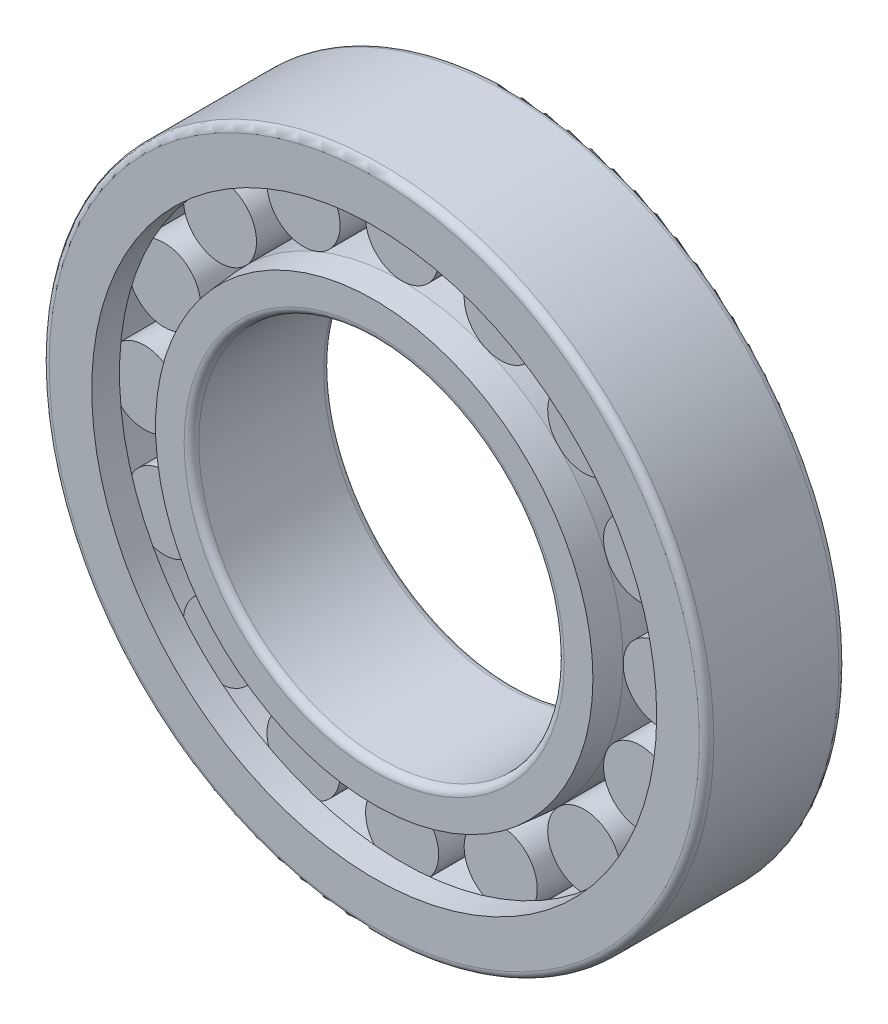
ISO-10303-21;
HEADER;
FILE_DESCRIPTION(('STEP AP214'),'2;1');
FILE_NAME('part.step','',(''),(''),'','','');
FILE_SCHEMA(('AUTOMOTIVE_DESIGN { 1 0 10303 214 1 1 1 1 }'));
ENDSEC;
DATA;
#1=APPLICATION_CONTEXT('core data for automotive mechanical design processes');
#2=APPLICATION_PROTOCOL_DEFINITION('international standard','automotive_design',2000,#1);
#3=PRODUCT_CONTEXT('',#1,'mechanical');
#4=PRODUCT('Part','Part','',(#3));
#5=PRODUCT_RELATED_PRODUCT_CATEGORY('part','',(#4));
#6=PRODUCT_DEFINITION_FORMATION('','',#4);
#7=PRODUCT_DEFINITION_CONTEXT('part definition',#1,'design');
#8=PRODUCT_DEFINITION('design','',#6,#7);
#9=PRODUCT_DEFINITION_SHAPE('','',#8);
#10=(LENGTH_UNIT() NAMED_UNIT(*) SI_UNIT(.MILLI.,.METRE.));
#11=(NAMED_UNIT(*) PLANE_ANGLE_UNIT() SI_UNIT($,.RADIAN.));
#12=(NAMED_UNIT(*) SI_UNIT($,.STERADIAN.) SOLID_ANGLE_UNIT());
#13=UNCERTAINTY_MEASURE_WITH_UNIT(LENGTH_MEASURE(1.E-05),#10,'distance_accuracy_value','');
#14=(GEOMETRIC_REPRESENTATION_CONTEXT(3) GLOBAL_UNCERTAINTY_ASSIGNED_CONTEXT((#13)) GLOBAL_UNIT_ASSIGNED_CONTEXT((#10,
#11,#12)) REPRESENTATION_CONTEXT('',''));
#15=CARTESIAN_POINT('',(0.,0.,0.));
#16=DIRECTION('',(0.,0.,1.));
#17=DIRECTION('',(1.,0.,0.));
#18=AXIS2_PLACEMENT_3D('',#15,#16,#17);
#19=CARTESIAN_POINT('',(0.,27.5,10.5));
#20=DIRECTION('',(0.,0.,-1.));
#21=DIRECTION('',(-1.,0.,0.));
#22=AXIS2_PLACEMENT_3D('',#19,#20,#21);
#23=PLANE('',#22);
#24=CARTESIAN_POINT('',(0.,0.,10.5));
#25=DIRECTION('',(0.,0.,-1.));
#26=DIRECTION('',(-1.,0.,0.));
#27=AXIS2_PLACEMENT_3D('',#24,#25,#26);
#28=CIRCLE('',#27,28.6);
#29=CARTESIAN_POINT('',(-28.6,0.,10.5));
#30=VERTEX_POINT('',#29);
#31=EDGE_CURVE('E798',#30,#30,#28,.T.);
#32=ORIENTED_EDGE('',*,*,#31,.T.);
#33=EDGE_LOOP('',(#32));
#34=FACE_BOUND('',#33,.T.);
#35=CARTESIAN_POINT('',(0.,0.,10.5));
#36=DIRECTION('',(0.,0.,1.));
#37=DIRECTION('',(1.,0.,0.));
#38=AXIS2_PLACEMENT_3D('',#35,#36,#37);
#39=CIRCLE('',#38,32.9047348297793);
#40=CARTESIAN_POINT('',(32.9047348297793,0.,10.5));
#41=VERTEX_POINT('',#40);
#42=EDGE_CURVE('E727',#41,#41,#39,.T.);
#43=ORIENTED_EDGE('',*,*,#42,.T.);
#44=EDGE_LOOP('',(#43));
#45=FACE_BOUND('',#44,.T.);
#46=ADVANCED_FACE('F35',(#34,#45),#23,.F.);
#47=CARTESIAN_POINT('',(0.,27.5,-10.5));
#48=DIRECTION('',(0.,0.,1.));
#49=DIRECTION('',(1.,0.,0.));
#50=AXIS2_PLACEMENT_3D('',#47,#48,#49);
#51=PLANE('',#50);
#52=CARTESIAN_POINT('',(0.,0.,-10.5));
#53=DIRECTION('',(0.,0.,1.));
#54=DIRECTION('',(1.,0.,0.));
#55=AXIS2_PLACEMENT_3D('',#52,#53,#54);
#56=CIRCLE('',#55,28.6);
#57=CARTESIAN_POINT('',(28.6,0.,-10.5));
#58=VERTEX_POINT('',#57);
#59=EDGE_CURVE('E789',#58,#58,#56,.T.);
#60=ORIENTED_EDGE('',*,*,#59,.T.);
#61=EDGE_LOOP('',(#60));
#62=FACE_BOUND('',#61,.T.);
#63=CARTESIAN_POINT('',(0.,0.,-10.5));
#64=DIRECTION('',(0.,0.,1.));
#65=DIRECTION('',(1.,0.,0.));
#66=AXIS2_PLACEMENT_3D('',#63,#64,#65);
#67=CIRCLE('',#66,32.9047348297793);
#68=CARTESIAN_POINT('',(32.9047348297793,0.,-10.5));
#69=VERTEX_POINT('',#68);
#70=EDGE_CURVE('E733',#69,#69,#67,.T.);
#71=ORIENTED_EDGE('',*,*,#70,.F.);
#72=EDGE_LOOP('',(#71));
#73=FACE_BOUND('',#72,.T.);
#74=ADVANCED_FACE('F1003',(#62,#73),#51,.F.);
#75=CARTESIAN_POINT('',(0.,33.25,6.3));
#76=DIRECTION('',(0.,0.,1.));
#77=DIRECTION('',(1.,0.,0.));
#78=AXIS2_PLACEMENT_3D('',#75,#76,#77);
#79=PLANE('',#78);
#80=CARTESIAN_POINT('',(0.,38.75,6.3));
#81=DIRECTION('',(0.,0.,1.));
#82=DIRECTION('',(1.,0.,0.));
#83=AXIS2_PLACEMENT_3D('',#80,#81,#82);
#84=CIRCLE('',#83,5.50000000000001);
#85=CARTESIAN_POINT('',(-0.500647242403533,44.2271664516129,6.3));
#86=VERTEX_POINT('',#85);
#87=CARTESIAN_POINT('',(-0.434207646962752,33.2671664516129,6.3));
#88=VERTEX_POINT('',#87);
#89=EDGE_CURVE('E770',#86,#88,#84,.T.);
#90=ORIENTED_EDGE('',*,*,#89,.T.);
#91=CARTESIAN_POINT('',(0.,0.,6.3));
#92=DIRECTION('',(0.,0.,1.));
#93=DIRECTION('',(1.,0.,0.));
#94=AXIS2_PLACEMENT_3D('',#91,#92,#93);
#95=CIRCLE('',#94,33.27);
#96=CARTESIAN_POINT('',(0.434207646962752,33.2671664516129,6.3));
#97=VERTEX_POINT('',#96);
#98=EDGE_CURVE('E742',#88,#97,#95,.F.);
#99=ORIENTED_EDGE('',*,*,#98,.T.);
#100=CARTESIAN_POINT('',(0.500647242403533,44.2271664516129,6.3));
#101=VERTEX_POINT('',#100);
#102=EDGE_CURVE('E769',#97,#101,#84,.T.);
#103=ORIENTED_EDGE('',*,*,#102,.T.);
#104=CARTESIAN_POINT('',(0.,0.,6.3));
#105=DIRECTION('',(0.,0.,1.));
#106=DIRECTION('',(1.,0.,0.));
#107=AXIS2_PLACEMENT_3D('',#104,#105,#106);
#108=CIRCLE('',#107,44.23);
#109=EDGE_CURVE('E766',#101,#86,#108,.T.);
#110=ORIENTED_EDGE('',*,*,#109,.T.);
#111=EDGE_LOOP('',(#90,#99,#103,#110));
#112=FACE_BOUND('',#111,.T.);
#113=ADVANCED_FACE('F1009',(#112),#79,.T.);
#114=CARTESIAN_POINT('',(0.,33.25,-6.30000000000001));
#115=DIRECTION('',(0.,0.,-1.));
#116=DIRECTION('',(-1.,0.,0.));
#117=AXIS2_PLACEMENT_3D('',#114,#115,#116);
#118=PLANE('',#117);
#119=CARTESIAN_POINT('',(0.,38.75,-6.3));
#120=DIRECTION('',(0.,0.,1.));
#121=DIRECTION('',(1.,0.,0.));
#122=AXIS2_PLACEMENT_3D('',#119,#120,#121);
#123=CIRCLE('',#122,5.50000000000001);
#124=CARTESIAN_POINT('',(0.434207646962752,33.2671664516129,-6.3));
#125=VERTEX_POINT('',#124);
#126=CARTESIAN_POINT('',(0.500647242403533,44.2271664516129,-6.3));
#127=VERTEX_POINT('',#126);
#128=EDGE_CURVE('E773',#125,#127,#123,.T.);
#129=ORIENTED_EDGE('',*,*,#128,.F.);
#130=CARTESIAN_POINT('',(0.,0.,-6.30000000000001));
#131=DIRECTION('',(0.,0.,-1.));
#132=DIRECTION('',(-1.,0.,0.));
#133=AXIS2_PLACEMENT_3D('',#130,#131,#132);
#134=CIRCLE('',#133,33.27);
#135=CARTESIAN_POINT('',(-0.434207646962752,33.2671664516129,-6.3));
#136=VERTEX_POINT('',#135);
#137=EDGE_CURVE('E739',#125,#136,#134,.F.);
#138=ORIENTED_EDGE('',*,*,#137,.T.);
#139=CARTESIAN_POINT('',(-0.500647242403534,44.2271664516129,-6.3));
#140=VERTEX_POINT('',#139);
#141=EDGE_CURVE('E774',#140,#136,#123,.T.);
#142=ORIENTED_EDGE('',*,*,#141,.F.);
#143=CARTESIAN_POINT('',(0.,0.,-6.30000000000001));
#144=DIRECTION('',(0.,0.,-1.));
#145=DIRECTION('',(-1.,0.,0.));
#146=AXIS2_PLACEMENT_3D('',#143,#144,#145);
#147=CIRCLE('',#146,44.23);
#148=EDGE_CURVE('E763',#140,#127,#147,.T.);
#149=ORIENTED_EDGE('',*,*,#148,.T.);
#150=EDGE_LOOP('',(#129,#138,#142,#149));
#151=FACE_BOUND('',#150,.T.);
#152=ADVANCED_FACE('F1049',(#151),#118,.T.);
#153=CARTESIAN_POINT('',(0.,38.75,6.3));
#154=DIRECTION('',(0.,0.,1.));
#155=DIRECTION('',(1.,0.,0.));
#156=AXIS2_PLACEMENT_3D('',#153,#154,#155);
#157=CYLINDRICAL_SURFACE('',#156,5.50000000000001);
#158=ORIENTED_EDGE('',*,*,#102,.F.);
#159=DIRECTION('',(0.,0.,1.));
#160=VECTOR('',#159,1.);
#161=CARTESIAN_POINT('',(0.434207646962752,33.2671664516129,0.));
#162=LINE('',#161,#160);
#163=EDGE_CURVE('E786',#97,#125,#162,.F.);
#164=ORIENTED_EDGE('',*,*,#163,.T.);
#165=ORIENTED_EDGE('',*,*,#128,.T.);
#166=DIRECTION('',(0.,0.,1.));
#167=VECTOR('',#166,1.);
#168=CARTESIAN_POINT('',(0.500647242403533,44.2271664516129,0.));
#169=LINE('',#168,#167);
#170=EDGE_CURVE('E780',#127,#101,#169,.T.);
#171=ORIENTED_EDGE('',*,*,#170,.T.);
#172=EDGE_LOOP('',(#158,#164,#165,#171));
#173=FACE_BOUND('',#172,.T.);
#174=ADVANCED_FACE('F1046',(#173),#157,.T.);
#175=ORIENTED_EDGE('',*,*,#141,.T.);
#176=DIRECTION('',(0.,0.,1.));
#177=VECTOR('',#176,1.);
#178=CARTESIAN_POINT('',(-0.434207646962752,33.2671664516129,0.));
#179=LINE('',#178,#177);
#180=EDGE_CURVE('E783',#136,#88,#179,.T.);
#181=ORIENTED_EDGE('',*,*,#180,.T.);
#182=ORIENTED_EDGE('',*,*,#89,.F.);
#183=DIRECTION('',(0.,0.,1.));
#184=VECTOR('',#183,1.);
#185=CARTESIAN_POINT('',(-0.500647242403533,44.2271664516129,0.));
#186=LINE('',#185,#184);
#187=EDGE_CURVE('E777',#86,#140,#186,.F.);
#188=ORIENTED_EDGE('',*,*,#187,.T.);
#189=EDGE_LOOP('',(#175,#181,#182,#188));
#190=FACE_BOUND('',#189,.T.);
#191=ADVANCED_FACE('F1044',(#190),#157,.T.);
#192=CARTESIAN_POINT('',(0.,50.,10.5));
#193=DIRECTION('',(0.,0.,-1.));
#194=DIRECTION('',(-1.,0.,0.));
#195=AXIS2_PLACEMENT_3D('',#192,#193,#194);
#196=PLANE('',#195);
#197=CARTESIAN_POINT('',(0.,0.,10.5));
#198=DIRECTION('',(0.,0.,-1.));
#199=DIRECTION('',(-1.,0.,0.));
#200=AXIS2_PLACEMENT_3D('',#197,#198,#199);
#201=CIRCLE('',#200,48.9);
#202=CARTESIAN_POINT('',(-48.9,0.,10.5));
#203=VERTEX_POINT('',#202);
#204=EDGE_CURVE('E810',#203,#203,#201,.F.);
#205=ORIENTED_EDGE('',*,*,#204,.T.);
#206=EDGE_LOOP('',(#205));
#207=FACE_BOUND('',#206,.T.);
#208=CARTESIAN_POINT('',(0.,0.,10.5));
#209=DIRECTION('',(0.,0.,1.));
#210=DIRECTION('',(1.,0.,0.));
#211=AXIS2_PLACEMENT_3D('',#208,#209,#210);
#212=CIRCLE('',#211,42.5);
#213=CARTESIAN_POINT('',(42.5,0.,10.5));
#214=VERTEX_POINT('',#213);
#215=EDGE_CURVE('E760',#214,#214,#212,.T.);
#216=ORIENTED_EDGE('',*,*,#215,.F.);
#217=EDGE_LOOP('',(#216));
#218=FACE_BOUND('',#217,.T.);
#219=ADVANCED_FACE('F1040',(#207,#218),#196,.F.);
#220=CARTESIAN_POINT('',(0.,0.,50.3916163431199));
#221=DIRECTION('',(0.,0.,1.));
#222=DIRECTION('',(1.,0.,0.));
#223=AXIS2_PLACEMENT_3D('',#220,#221,#222);
#224=CYLINDRICAL_SURFACE('',#223,42.5);
#225=CARTESIAN_POINT('',(0.,0.,6.325));
#226=DIRECTION('',(0.,0.,1.));
#227=DIRECTION('',(1.,0.,0.));
#228=AXIS2_PLACEMENT_3D('',#225,#226,#227);
#229=CIRCLE('',#228,42.5);
#230=CARTESIAN_POINT('',(42.5,0.,6.325));
#231=VERTEX_POINT('',#230);
#232=EDGE_CURVE('E757',#231,#231,#229,.T.);
#233=ORIENTED_EDGE('',*,*,#232,.F.);
#234=EDGE_LOOP('',(#233));
#235=FACE_BOUND('',#234,.T.);
#236=ORIENTED_EDGE('',*,*,#215,.T.);
#237=EDGE_LOOP('',(#236));
#238=FACE_BOUND('',#237,.T.);
#239=ADVANCED_FACE('F1036',(#235,#238),#224,.F.);
#240=CARTESIAN_POINT('',(0.,42.5,6.325));
#241=DIRECTION('',(0.,0.,1.));
#242=DIRECTION('',(1.,0.,0.));
#243=AXIS2_PLACEMENT_3D('',#240,#241,#242);
#244=PLANE('',#243);
#245=CARTESIAN_POINT('',(0.,0.,6.325));
#246=DIRECTION('',(0.,0.,1.));
#247=DIRECTION('',(1.,0.,0.));
#248=AXIS2_PLACEMENT_3D('',#245,#246,#247);
#249=CIRCLE('',#248,44.23);
#250=CARTESIAN_POINT('',(44.23,0.,6.325));
#251=VERTEX_POINT('',#250);
#252=EDGE_CURVE('E754',#251,#251,#249,.T.);
#253=ORIENTED_EDGE('',*,*,#252,.F.);
#254=EDGE_LOOP('',(#253));
#255=FACE_BOUND('',#254,.T.);
#256=ORIENTED_EDGE('',*,*,#232,.T.);
#257=EDGE_LOOP('',(#256));
#258=FACE_BOUND('',#257,.T.);
#259=ADVANCED_FACE('F1033',(#255,#258),#244,.F.);
#260=CARTESIAN_POINT('',(0.,0.,50.3916163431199));
#261=DIRECTION('',(0.,0.,1.));
#262=DIRECTION('',(1.,0.,0.));
#263=AXIS2_PLACEMENT_3D('',#260,#261,#262);
#264=CYLINDRICAL_SURFACE('',#263,44.23);
#265=CARTESIAN_POINT('',(0.,0.,-6.30000000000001));
#266=DIRECTION('',(0.,0.,-1.));
#267=DIRECTION('',(-1.,0.,0.));
#268=AXIS2_PLACEMENT_3D('',#265,#266,#267);
#269=CIRCLE('',#268,44.23);
#270=CARTESIAN_POINT('',(-16.4624661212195,41.0521632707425,-6.3));
#271=VERTEX_POINT('',#270);
#272=CARTESIAN_POINT('',(-17.3875416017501,40.6689844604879,-6.3));
#273=VERTEX_POINT('',#272);
#274=EDGE_CURVE('E445',#271,#273,#269,.F.);
#275=ORIENTED_EDGE('',*,*,#274,.T.);
#276=DIRECTION('',(0.,0.,1.));
#277=VECTOR('',#276,1.);
#278=CARTESIAN_POINT('',(-17.3875416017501,40.6689844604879,0.));
#279=LINE('',#278,#277);
#280=CARTESIAN_POINT('',(-17.3875416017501,40.6689844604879,6.3));
#281=VERTEX_POINT('',#280);
#282=EDGE_CURVE('E436',#273,#281,#279,.T.);
#283=ORIENTED_EDGE('',*,*,#282,.T.);
#284=CARTESIAN_POINT('',(0.,0.,6.3));
#285=DIRECTION('',(0.,0.,1.));
#286=DIRECTION('',(1.,0.,0.));
#287=AXIS2_PLACEMENT_3D('',#284,#285,#286);
#288=CIRCLE('',#287,44.23);
#289=CARTESIAN_POINT('',(-16.4624661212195,41.0521632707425,6.3));
#290=VERTEX_POINT('',#289);
#291=EDGE_CURVE('E456',#281,#290,#288,.F.);
#292=ORIENTED_EDGE('',*,*,#291,.T.);
#293=DIRECTION('',(0.,0.,1.));
#294=VECTOR('',#293,1.);
#295=CARTESIAN_POINT('',(-16.4624661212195,41.0521632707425,0.));
#296=LINE('',#295,#294);
#297=EDGE_CURVE('E446',#290,#271,#296,.F.);
#298=ORIENTED_EDGE('',*,*,#297,.T.);
#299=EDGE_LOOP('',(#275,#283,#292,#298));
#300=FACE_BOUND('',#299,.T.);
#301=CARTESIAN_POINT('',(0.,0.,-6.30000000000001));
#302=DIRECTION('',(0.,0.,-1.));
#303=DIRECTION('',(-1.,0.,0.));
#304=AXIS2_PLACEMENT_3D('',#301,#302,#303);
#305=CIRCLE('',#304,44.23);
#306=CARTESIAN_POINT('',(-30.919318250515,31.6273403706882,-6.3));
#307=VERTEX_POINT('',#306);
#308=CARTESIAN_POINT('',(-31.6273403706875,30.9193182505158,-6.3));
#309=VERTEX_POINT('',#308);
#310=EDGE_CURVE('E474',#307,#309,#305,.F.);
#311=ORIENTED_EDGE('',*,*,#310,.T.);
#312=DIRECTION('',(0.,0.,1.));
#313=VECTOR('',#312,1.);
#314=CARTESIAN_POINT('',(-31.6273403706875,30.9193182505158,0.));
#315=LINE('',#314,#313);
#316=CARTESIAN_POINT('',(-31.6273403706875,30.9193182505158,6.3));
#317=VERTEX_POINT('',#316);
#318=EDGE_CURVE('E471',#309,#317,#315,.T.);
#319=ORIENTED_EDGE('',*,*,#318,.T.);
#320=CARTESIAN_POINT('',(0.,0.,6.3));
#321=DIRECTION('',(0.,0.,1.));
#322=DIRECTION('',(1.,0.,0.));
#323=AXIS2_PLACEMENT_3D('',#320,#321,#322);
#324=CIRCLE('',#323,44.23);
#325=CARTESIAN_POINT('',(-30.919318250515,31.6273403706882,6.3));
#326=VERTEX_POINT('',#325);
#327=EDGE_CURVE('E477',#317,#326,#324,.F.);
#328=ORIENTED_EDGE('',*,*,#327,.T.);
#329=DIRECTION('',(0.,0.,1.));
#330=VECTOR('',#329,1.);
#331=CARTESIAN_POINT('',(-30.919318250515,31.6273403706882,0.));
#332=LINE('',#331,#330);
#333=EDGE_CURVE('E468',#326,#307,#332,.F.);
#334=ORIENTED_EDGE('',*,*,#333,.T.);
#335=EDGE_LOOP('',(#311,#319,#328,#334));
#336=FACE_BOUND('',#335,.T.);
#337=CARTESIAN_POINT('',(0.,0.,-6.30000000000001));
#338=DIRECTION('',(0.,0.,-1.));
#339=DIRECTION('',(-1.,0.,0.));
#340=AXIS2_PLACEMENT_3D('',#337,#338,#339);
#341=CIRCLE('',#340,44.23);
#342=CARTESIAN_POINT('',(-40.6689844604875,17.3875416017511,-6.3));
#343=VERTEX_POINT('',#342);
#344=CARTESIAN_POINT('',(-41.0521632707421,16.4624661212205,-6.3));
#345=VERTEX_POINT('',#344);
#346=EDGE_CURVE('E493',#343,#345,#341,.F.);
#347=ORIENTED_EDGE('',*,*,#346,.T.);
#348=DIRECTION('',(0.,0.,1.));
#349=VECTOR('',#348,1.);
#350=CARTESIAN_POINT('',(-41.0521632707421,16.4624661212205,0.));
#351=LINE('',#350,#349);
#352=CARTESIAN_POINT('',(-41.0521632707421,16.4624661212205,6.3));
#353=VERTEX_POINT('',#352);
#354=EDGE_CURVE('E490',#345,#353,#351,.T.);
#355=ORIENTED_EDGE('',*,*,#354,.T.);
#356=CARTESIAN_POINT('',(0.,0.,6.3));
#357=DIRECTION('',(0.,0.,1.));
#358=DIRECTION('',(1.,0.,0.));
#359=AXIS2_PLACEMENT_3D('',#356,#357,#358);
#360=CIRCLE('',#359,44.23);
#361=CARTESIAN_POINT('',(-40.6689844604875,17.3875416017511,6.3));
#362=VERTEX_POINT('',#361);
#363=EDGE_CURVE('E496',#353,#362,#360,.F.);
#364=ORIENTED_EDGE('',*,*,#363,.T.);
#365=DIRECTION('',(0.,0.,1.));
#366=VECTOR('',#365,1.);
#367=CARTESIAN_POINT('',(-40.6689844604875,17.3875416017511,0.));
#368=LINE('',#367,#366);
#369=EDGE_CURVE('E487',#362,#343,#368,.F.);
#370=ORIENTED_EDGE('',*,*,#369,.T.);
#371=EDGE_LOOP('',(#347,#355,#364,#370));
#372=FACE_BOUND('',#371,.T.);
#373=CARTESIAN_POINT('',(0.,0.,-6.30000000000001));
#374=DIRECTION('',(0.,0.,-1.));
#375=DIRECTION('',(-1.,0.,0.));
#376=AXIS2_PLACEMENT_3D('',#373,#374,#375);
#377=CIRCLE('',#376,44.23);
#378=CARTESIAN_POINT('',(-44.2271664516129,0.50064724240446,-6.3));
#379=VERTEX_POINT('',#378);
#380=CARTESIAN_POINT('',(-44.2271664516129,-0.500647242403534,-6.3));
#381=VERTEX_POINT('',#380);
#382=EDGE_CURVE('E512',#379,#381,#377,.F.);
#383=ORIENTED_EDGE('',*,*,#382,.T.);
#384=DIRECTION('',(0.,0.,1.));
#385=VECTOR('',#384,1.);
#386=CARTESIAN_POINT('',(-44.2271664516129,-0.500647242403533,0.));
#387=LINE('',#386,#385);
#388=CARTESIAN_POINT('',(-44.2271664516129,-0.500647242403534,6.3));
#389=VERTEX_POINT('',#388);
#390=EDGE_CURVE('E509',#381,#389,#387,.T.);
#391=ORIENTED_EDGE('',*,*,#390,.T.);
#392=CARTESIAN_POINT('',(0.,0.,6.3));
#393=DIRECTION('',(0.,0.,1.));
#394=DIRECTION('',(1.,0.,0.));
#395=AXIS2_PLACEMENT_3D('',#392,#393,#394);
#396=CIRCLE('',#395,44.23);
#397=CARTESIAN_POINT('',(-44.2271664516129,0.50064724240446,6.3));
#398=VERTEX_POINT('',#397);
#399=EDGE_CURVE('E515',#389,#398,#396,.F.);
#400=ORIENTED_EDGE('',*,*,#399,.T.);
#401=DIRECTION('',(0.,0.,1.));
#402=VECTOR('',#401,1.);
#403=CARTESIAN_POINT('',(-44.2271664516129,0.50064724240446,0.));
#404=LINE('',#403,#402);
#405=EDGE_CURVE('E506',#398,#379,#404,.F.);
#406=ORIENTED_EDGE('',*,*,#405,.T.);
#407=EDGE_LOOP('',(#383,#391,#400,#406));
#408=FACE_BOUND('',#407,.T.);
#409=CARTESIAN_POINT('',(0.,0.,-6.30000000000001));
#410=DIRECTION('',(0.,0.,-1.));
#411=DIRECTION('',(-1.,0.,0.));
#412=AXIS2_PLACEMENT_3D('',#409,#410,#411);
#413=CIRCLE('',#412,44.23);
#414=CARTESIAN_POINT('',(-41.0521632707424,-16.4624661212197,-6.3));
#415=VERTEX_POINT('',#414);
#416=CARTESIAN_POINT('',(-40.6689844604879,-17.3875416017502,-6.3));
#417=VERTEX_POINT('',#416);
#418=EDGE_CURVE('E531',#415,#417,#413,.F.);
#419=ORIENTED_EDGE('',*,*,#418,.T.);
#420=DIRECTION('',(0.,0.,1.));
#421=VECTOR('',#420,1.);
#422=CARTESIAN_POINT('',(-40.6689844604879,-17.3875416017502,0.));
#423=LINE('',#422,#421);
#424=CARTESIAN_POINT('',(-40.6689844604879,-17.3875416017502,6.3));
#425=VERTEX_POINT('',#424);
#426=EDGE_CURVE('E528',#417,#425,#423,.T.);
#427=ORIENTED_EDGE('',*,*,#426,.T.);
#428=CARTESIAN_POINT('',(0.,0.,6.3));
#429=DIRECTION('',(0.,0.,1.));
#430=DIRECTION('',(1.,0.,0.));
#431=AXIS2_PLACEMENT_3D('',#428,#429,#430);
#432=CIRCLE('',#431,44.23);
#433=CARTESIAN_POINT('',(-41.0521632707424,-16.4624661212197,6.3));
#434=VERTEX_POINT('',#433);
#435=EDGE_CURVE('E534',#425,#434,#432,.F.);
#436=ORIENTED_EDGE('',*,*,#435,.T.);
#437=DIRECTION('',(0.,0.,1.));
#438=VECTOR('',#437,1.);
#439=CARTESIAN_POINT('',(-41.0521632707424,-16.4624661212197,0.));
#440=LINE('',#439,#438);
#441=EDGE_CURVE('E525',#434,#415,#440,.F.);
#442=ORIENTED_EDGE('',*,*,#441,.T.);
#443=EDGE_LOOP('',(#419,#427,#436,#442));
#444=FACE_BOUND('',#443,.T.);
#445=CARTESIAN_POINT('',(0.,0.,-6.30000000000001));
#446=DIRECTION('',(0.,0.,-1.));
#447=DIRECTION('',(-1.,0.,0.));
#448=AXIS2_PLACEMENT_3D('',#445,#446,#447);
#449=CIRCLE('',#448,44.23);
#450=CARTESIAN_POINT('',(-31.6273403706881,-30.9193182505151,-6.3));
#451=VERTEX_POINT('',#450);
#452=CARTESIAN_POINT('',(-30.9193182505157,-31.6273403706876,-6.3));
#453=VERTEX_POINT('',#452);
#454=EDGE_CURVE('E550',#451,#453,#449,.F.);
#455=ORIENTED_EDGE('',*,*,#454,.T.);
#456=DIRECTION('',(0.,0.,1.));
#457=VECTOR('',#456,1.);
#458=CARTESIAN_POINT('',(-30.9193182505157,-31.6273403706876,0.));
#459=LINE('',#458,#457);
#460=CARTESIAN_POINT('',(-30.9193182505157,-31.6273403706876,6.3));
#461=VERTEX_POINT('',#460);
#462=EDGE_CURVE('E547',#453,#461,#459,.T.);
#463=ORIENTED_EDGE('',*,*,#462,.T.);
#464=CARTESIAN_POINT('',(0.,0.,6.3));
#465=DIRECTION('',(0.,0.,1.));
#466=DIRECTION('',(1.,0.,0.));
#467=AXIS2_PLACEMENT_3D('',#464,#465,#466);
#468=CIRCLE('',#467,44.23);
#469=CARTESIAN_POINT('',(-31.6273403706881,-30.9193182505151,6.3));
#470=VERTEX_POINT('',#469);
#471=EDGE_CURVE('E553',#461,#470,#468,.F.);
#472=ORIENTED_EDGE('',*,*,#471,.T.);
#473=DIRECTION('',(0.,0.,1.));
#474=VECTOR('',#473,1.);
#475=CARTESIAN_POINT('',(-31.6273403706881,-30.9193182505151,0.));
#476=LINE('',#475,#474);
#477=EDGE_CURVE('E544',#470,#451,#476,.F.);
#478=ORIENTED_EDGE('',*,*,#477,.T.);
#479=EDGE_LOOP('',(#455,#463,#472,#478));
#480=FACE_BOUND('',#479,.T.);
#481=CARTESIAN_POINT('',(0.,0.,-6.30000000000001));
#482=DIRECTION('',(0.,0.,-1.));
#483=DIRECTION('',(-1.,0.,0.));
#484=AXIS2_PLACEMENT_3D('',#481,#482,#483);
#485=CIRCLE('',#484,44.23);
#486=CARTESIAN_POINT('',(-17.3875416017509,-40.6689844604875,-6.3));
#487=VERTEX_POINT('',#486);
#488=CARTESIAN_POINT('',(-16.4624661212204,-41.0521632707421,-6.3));
#489=VERTEX_POINT('',#488);
#490=EDGE_CURVE('E569',#487,#489,#485,.F.);
#491=ORIENTED_EDGE('',*,*,#490,.T.);
#492=DIRECTION('',(0.,0.,1.));
#493=VECTOR('',#492,1.);
#494=CARTESIAN_POINT('',(-16.4624661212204,-41.0521632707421,0.));
#495=LINE('',#494,#493);
#496=CARTESIAN_POINT('',(-16.4624661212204,-41.0521632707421,6.3));
#497=VERTEX_POINT('',#496);
#498=EDGE_CURVE('E566',#489,#497,#495,.T.);
#499=ORIENTED_EDGE('',*,*,#498,.T.);
#500=CARTESIAN_POINT('',(0.,0.,6.3));
#501=DIRECTION('',(0.,0.,1.));
#502=DIRECTION('',(1.,0.,0.));
#503=AXIS2_PLACEMENT_3D('',#500,#501,#502);
#504=CIRCLE('',#503,44.23);
#505=CARTESIAN_POINT('',(-17.3875416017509,-40.6689844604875,6.3));
#506=VERTEX_POINT('',#505);
#507=EDGE_CURVE('E572',#497,#506,#504,.F.);
#508=ORIENTED_EDGE('',*,*,#507,.T.);
#509=DIRECTION('',(0.,0.,1.));
#510=VECTOR('',#509,1.);
#511=CARTESIAN_POINT('',(-17.3875416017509,-40.6689844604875,0.));
#512=LINE('',#511,#510);
#513=EDGE_CURVE('E563',#506,#487,#512,.F.);
#514=ORIENTED_EDGE('',*,*,#513,.T.);
#515=EDGE_LOOP('',(#491,#499,#508,#514));
#516=FACE_BOUND('',#515,.T.);
#517=CARTESIAN_POINT('',(0.,0.,-6.30000000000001));
#518=DIRECTION('',(0.,0.,-1.));
#519=DIRECTION('',(-1.,0.,0.));
#520=AXIS2_PLACEMENT_3D('',#517,#518,#519);
#521=CIRCLE('',#520,44.23);
#522=CARTESIAN_POINT('',(-0.500647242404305,-44.2271664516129,-6.3));
#523=VERTEX_POINT('',#522);
#524=CARTESIAN_POINT('',(0.500647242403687,-44.2271664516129,-6.3));
#525=VERTEX_POINT('',#524);
#526=EDGE_CURVE('E588',#523,#525,#521,.F.);
#527=ORIENTED_EDGE('',*,*,#526,.T.);
#528=DIRECTION('',(0.,0.,1.));
#529=VECTOR('',#528,1.);
#530=CARTESIAN_POINT('',(0.500647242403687,-44.2271664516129,0.));
#531=LINE('',#530,#529);
#532=CARTESIAN_POINT('',(0.500647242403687,-44.2271664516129,6.3));
#533=VERTEX_POINT('',#532);
#534=EDGE_CURVE('E585',#525,#533,#531,.T.);
#535=ORIENTED_EDGE('',*,*,#534,.T.);
#536=CARTESIAN_POINT('',(0.,0.,6.3));
#537=DIRECTION('',(0.,0.,1.));
#538=DIRECTION('',(1.,0.,0.));
#539=AXIS2_PLACEMENT_3D('',#536,#537,#538);
#540=CIRCLE('',#539,44.23);
#541=CARTESIAN_POINT('',(-0.500647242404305,-44.2271664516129,6.3));
#542=VERTEX_POINT('',#541);
#543=EDGE_CURVE('E591',#533,#542,#540,.F.);
#544=ORIENTED_EDGE('',*,*,#543,.T.);
#545=DIRECTION('',(0.,0.,1.));
#546=VECTOR('',#545,1.);
#547=CARTESIAN_POINT('',(-0.500647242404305,-44.2271664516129,0.));
#548=LINE('',#547,#546);
#549=EDGE_CURVE('E582',#542,#523,#548,.F.);
#550=ORIENTED_EDGE('',*,*,#549,.T.);
#551=EDGE_LOOP('',(#527,#535,#544,#550));
#552=FACE_BOUND('',#551,.T.);
#553=CARTESIAN_POINT('',(0.,0.,-6.30000000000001));
#554=DIRECTION('',(0.,0.,-1.));
#555=DIRECTION('',(-1.,0.,0.));
#556=AXIS2_PLACEMENT_3D('',#553,#554,#555);
#557=CIRCLE('',#556,44.23);
#558=CARTESIAN_POINT('',(16.4624661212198,-41.0521632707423,-6.3));
#559=VERTEX_POINT('',#558);
#560=CARTESIAN_POINT('',(17.3875416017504,-40.6689844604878,-6.3));
#561=VERTEX_POINT('',#560);
#562=EDGE_CURVE('E607',#559,#561,#557,.F.);
#563=ORIENTED_EDGE('',*,*,#562,.T.);
#564=DIRECTION('',(0.,0.,1.));
#565=VECTOR('',#564,1.);
#566=CARTESIAN_POINT('',(17.3875416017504,-40.6689844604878,0.));
#567=LINE('',#566,#565);
#568=CARTESIAN_POINT('',(17.3875416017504,-40.6689844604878,6.3));
#569=VERTEX_POINT('',#568);
#570=EDGE_CURVE('E604',#561,#569,#567,.T.);
#571=ORIENTED_EDGE('',*,*,#570,.T.);
#572=CARTESIAN_POINT('',(0.,0.,6.3));
#573=DIRECTION('',(0.,0.,1.));
#574=DIRECTION('',(1.,0.,0.));
#575=AXIS2_PLACEMENT_3D('',#572,#573,#574);
#576=CIRCLE('',#575,44.23);
#577=CARTESIAN_POINT('',(16.4624661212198,-41.0521632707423,6.3));
#578=VERTEX_POINT('',#577);
#579=EDGE_CURVE('E610',#569,#578,#576,.F.);
#580=ORIENTED_EDGE('',*,*,#579,.T.);
#581=DIRECTION('',(0.,0.,1.));
#582=VECTOR('',#581,1.);
#583=CARTESIAN_POINT('',(16.4624661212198,-41.0521632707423,0.));
#584=LINE('',#583,#582);
#585=EDGE_CURVE('E601',#578,#559,#584,.F.);
#586=ORIENTED_EDGE('',*,*,#585,.T.);
#587=EDGE_LOOP('',(#563,#571,#580,#586));
#588=FACE_BOUND('',#587,.T.);
#589=CARTESIAN_POINT('',(0.,0.,-6.30000000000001));
#590=DIRECTION('',(0.,0.,-1.));
#591=DIRECTION('',(-1.,0.,0.));
#592=AXIS2_PLACEMENT_3D('',#589,#590,#591);
#593=CIRCLE('',#592,44.23);
#594=CARTESIAN_POINT('',(30.9193182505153,-31.627340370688,-6.3));
#595=VERTEX_POINT('',#594);
#596=CARTESIAN_POINT('',(31.6273403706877,-30.9193182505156,-6.3));
#597=VERTEX_POINT('',#596);
#598=EDGE_CURVE('E626',#595,#597,#593,.F.);
#599=ORIENTED_EDGE('',*,*,#598,.T.);
#600=DIRECTION('',(0.,0.,1.));
#601=VECTOR('',#600,1.);
#602=CARTESIAN_POINT('',(31.6273403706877,-30.9193182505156,0.));
#603=LINE('',#602,#601);
#604=CARTESIAN_POINT('',(31.6273403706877,-30.9193182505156,6.3));
#605=VERTEX_POINT('',#604);
#606=EDGE_CURVE('E623',#597,#605,#603,.T.);
#607=ORIENTED_EDGE('',*,*,#606,.T.);
#608=CARTESIAN_POINT('',(0.,0.,6.3));
#609=DIRECTION('',(0.,0.,1.));
#610=DIRECTION('',(1.,0.,0.));
#611=AXIS2_PLACEMENT_3D('',#608,#609,#610);
#612=CIRCLE('',#611,44.23);
#613=CARTESIAN_POINT('',(30.9193182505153,-31.627340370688,6.3));
#614=VERTEX_POINT('',#613);
#615=EDGE_CURVE('E629',#605,#614,#612,.F.);
#616=ORIENTED_EDGE('',*,*,#615,.T.);
#617=DIRECTION('',(0.,0.,1.));
#618=VECTOR('',#617,1.);
#619=CARTESIAN_POINT('',(30.9193182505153,-31.627340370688,0.));
#620=LINE('',#619,#618);
#621=EDGE_CURVE('E620',#614,#595,#620,.F.);
#622=ORIENTED_EDGE('',*,*,#621,.T.);
#623=EDGE_LOOP('',(#599,#607,#616,#622));
#624=FACE_BOUND('',#623,.T.);
#625=CARTESIAN_POINT('',(0.,0.,-6.30000000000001));
#626=DIRECTION('',(0.,0.,-1.));
#627=DIRECTION('',(-1.,0.,0.));
#628=AXIS2_PLACEMENT_3D('',#625,#626,#627);
#629=CIRCLE('',#628,44.23);
#630=CARTESIAN_POINT('',(40.6689844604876,-17.3875416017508,-6.3));
#631=VERTEX_POINT('',#630);
#632=CARTESIAN_POINT('',(41.0521632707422,-16.4624661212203,-6.3));
#633=VERTEX_POINT('',#632);
#634=EDGE_CURVE('E645',#631,#633,#629,.F.);
#635=ORIENTED_EDGE('',*,*,#634,.T.);
#636=DIRECTION('',(0.,0.,1.));
#637=VECTOR('',#636,1.);
#638=CARTESIAN_POINT('',(41.0521632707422,-16.4624661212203,0.));
#639=LINE('',#638,#637);
#640=CARTESIAN_POINT('',(41.0521632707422,-16.4624661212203,6.3));
#641=VERTEX_POINT('',#640);
#642=EDGE_CURVE('E642',#633,#641,#639,.T.);
#643=ORIENTED_EDGE('',*,*,#642,.T.);
#644=CARTESIAN_POINT('',(0.,0.,6.3));
#645=DIRECTION('',(0.,0.,1.));
#646=DIRECTION('',(1.,0.,0.));
#647=AXIS2_PLACEMENT_3D('',#644,#645,#646);
#648=CIRCLE('',#647,44.23);
#649=CARTESIAN_POINT('',(40.6689844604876,-17.3875416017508,6.3));
#650=VERTEX_POINT('',#649);
#651=EDGE_CURVE('E648',#641,#650,#648,.F.);
#652=ORIENTED_EDGE('',*,*,#651,.T.);
#653=DIRECTION('',(0.,0.,1.));
#654=VECTOR('',#653,1.);
#655=CARTESIAN_POINT('',(40.6689844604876,-17.3875416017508,0.));
#656=LINE('',#655,#654);
#657=EDGE_CURVE('E639',#650,#631,#656,.F.);
#658=ORIENTED_EDGE('',*,*,#657,.T.);
#659=EDGE_LOOP('',(#635,#643,#652,#658));
#660=FACE_BOUND('',#659,.T.);
#661=CARTESIAN_POINT('',(0.,0.,-6.30000000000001));
#662=DIRECTION('',(0.,0.,-1.));
#663=DIRECTION('',(-1.,0.,0.));
#664=AXIS2_PLACEMENT_3D('',#661,#662,#663);
#665=CIRCLE('',#664,44.23);
#666=CARTESIAN_POINT('',(44.2271664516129,-0.50064724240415,-6.3));
#667=VERTEX_POINT('',#666);
#668=CARTESIAN_POINT('',(44.2271664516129,0.500647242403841,-6.3));
#669=VERTEX_POINT('',#668);
#670=EDGE_CURVE('E664',#667,#669,#665,.F.);
#671=ORIENTED_EDGE('',*,*,#670,.T.);
#672=DIRECTION('',(0.,0.,1.));
#673=VECTOR('',#672,1.);
#674=CARTESIAN_POINT('',(44.2271664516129,0.500647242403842,0.));
#675=LINE('',#674,#673);
#676=CARTESIAN_POINT('',(44.2271664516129,0.500647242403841,6.3));
#677=VERTEX_POINT('',#676);
#678=EDGE_CURVE('E661',#669,#677,#675,.T.);
#679=ORIENTED_EDGE('',*,*,#678,.T.);
#680=CARTESIAN_POINT('',(0.,0.,6.3));
#681=DIRECTION('',(0.,0.,1.));
#682=DIRECTION('',(1.,0.,0.));
#683=AXIS2_PLACEMENT_3D('',#680,#681,#682);
#684=CIRCLE('',#683,44.23);
#685=CARTESIAN_POINT('',(44.2271664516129,-0.500647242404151,6.3));
#686=VERTEX_POINT('',#685);
#687=EDGE_CURVE('E667',#677,#686,#684,.F.);
#688=ORIENTED_EDGE('',*,*,#687,.T.);
#689=DIRECTION('',(0.,0.,1.));
#690=VECTOR('',#689,1.);
#691=CARTESIAN_POINT('',(44.2271664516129,-0.50064724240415,0.));
#692=LINE('',#691,#690);
#693=EDGE_CURVE('E658',#686,#667,#692,.F.);
#694=ORIENTED_EDGE('',*,*,#693,.T.);
#695=EDGE_LOOP('',(#671,#679,#688,#694));
#696=FACE_BOUND('',#695,.T.);
#697=CARTESIAN_POINT('',(0.,0.,-6.30000000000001));
#698=DIRECTION('',(0.,0.,-1.));
#699=DIRECTION('',(-1.,0.,0.));
#700=AXIS2_PLACEMENT_3D('',#697,#698,#699);
#701=CIRCLE('',#700,44.23);
#702=CARTESIAN_POINT('',(41.0521632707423,16.46246612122,-6.3));
#703=VERTEX_POINT('',#702);
#704=CARTESIAN_POINT('',(40.6689844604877,17.3875416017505,-6.3));
#705=VERTEX_POINT('',#704);
#706=EDGE_CURVE('E683',#703,#705,#701,.F.);
#707=ORIENTED_EDGE('',*,*,#706,.T.);
#708=DIRECTION('',(0.,0.,1.));
#709=VECTOR('',#708,1.);
#710=CARTESIAN_POINT('',(40.6689844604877,17.3875416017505,0.));
#711=LINE('',#710,#709);
#712=CARTESIAN_POINT('',(40.6689844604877,17.3875416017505,6.3));
#713=VERTEX_POINT('',#712);
#714=EDGE_CURVE('E680',#705,#713,#711,.T.);
#715=ORIENTED_EDGE('',*,*,#714,.T.);
#716=CARTESIAN_POINT('',(0.,0.,6.3));
#717=DIRECTION('',(0.,0.,1.));
#718=DIRECTION('',(1.,0.,0.));
#719=AXIS2_PLACEMENT_3D('',#716,#717,#718);
#720=CIRCLE('',#719,44.23);
#721=CARTESIAN_POINT('',(41.0521632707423,16.46246612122,6.3));
#722=VERTEX_POINT('',#721);
#723=EDGE_CURVE('E686',#713,#722,#720,.F.);
#724=ORIENTED_EDGE('',*,*,#723,.T.);
#725=DIRECTION('',(0.,0.,1.));
#726=VECTOR('',#725,1.);
#727=CARTESIAN_POINT('',(41.0521632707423,16.46246612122,0.));
#728=LINE('',#727,#726);
#729=EDGE_CURVE('E677',#722,#703,#728,.F.);
#730=ORIENTED_EDGE('',*,*,#729,.T.);
#731=EDGE_LOOP('',(#707,#715,#724,#730));
#732=FACE_BOUND('',#731,.T.);
#733=CARTESIAN_POINT('',(0.,0.,-6.30000000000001));
#734=DIRECTION('',(0.,0.,-1.));
#735=DIRECTION('',(-1.,0.,0.));
#736=AXIS2_PLACEMENT_3D('',#733,#734,#735);
#737=CIRCLE('',#736,44.23);
#738=CARTESIAN_POINT('',(31.6273403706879,30.9193182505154,-6.3));
#739=VERTEX_POINT('',#738);
#740=CARTESIAN_POINT('',(30.9193182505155,31.6273403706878,-6.3));
#741=VERTEX_POINT('',#740);
#742=EDGE_CURVE('E702',#739,#741,#737,.F.);
#743=ORIENTED_EDGE('',*,*,#742,.T.);
#744=DIRECTION('',(0.,0.,1.));
#745=VECTOR('',#744,1.);
#746=CARTESIAN_POINT('',(30.9193182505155,31.6273403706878,0.));
#747=LINE('',#746,#745);
#748=CARTESIAN_POINT('',(30.9193182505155,31.6273403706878,6.3));
#749=VERTEX_POINT('',#748);
#750=EDGE_CURVE('E699',#741,#749,#747,.T.);
#751=ORIENTED_EDGE('',*,*,#750,.T.);
#752=CARTESIAN_POINT('',(0.,0.,6.3));
#753=DIRECTION('',(0.,0.,1.));
#754=DIRECTION('',(1.,0.,0.));
#755=AXIS2_PLACEMENT_3D('',#752,#753,#754);
#756=CIRCLE('',#755,44.23);
#757=CARTESIAN_POINT('',(31.6273403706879,30.9193182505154,6.3));
#758=VERTEX_POINT('',#757);
#759=EDGE_CURVE('E705',#749,#758,#756,.F.);
#760=ORIENTED_EDGE('',*,*,#759,.T.);
#761=DIRECTION('',(0.,0.,1.));
#762=VECTOR('',#761,1.);
#763=CARTESIAN_POINT('',(31.6273403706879,30.9193182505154,0.));
#764=LINE('',#763,#762);
#765=EDGE_CURVE('E696',#758,#739,#764,.F.);
#766=ORIENTED_EDGE('',*,*,#765,.T.);
#767=EDGE_LOOP('',(#743,#751,#760,#766));
#768=FACE_BOUND('',#767,.T.);
#769=CARTESIAN_POINT('',(0.,0.,-6.30000000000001));
#770=DIRECTION('',(0.,0.,-1.));
#771=DIRECTION('',(-1.,0.,0.));
#772=AXIS2_PLACEMENT_3D('',#769,#770,#771);
#773=CIRCLE('',#772,44.23);
#774=CARTESIAN_POINT('',(17.3875416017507,40.6689844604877,-6.3));
#775=VERTEX_POINT('',#774);
#776=CARTESIAN_POINT('',(16.4624661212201,41.0521632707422,-6.3));
#777=VERTEX_POINT('',#776);
#778=EDGE_CURVE('E721',#775,#777,#773,.F.);
#779=ORIENTED_EDGE('',*,*,#778,.T.);
#780=DIRECTION('',(0.,0.,1.));
#781=VECTOR('',#780,1.);
#782=CARTESIAN_POINT('',(16.4624661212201,41.0521632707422,0.));
#783=LINE('',#782,#781);
#784=CARTESIAN_POINT('',(16.4624661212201,41.0521632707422,6.3));
#785=VERTEX_POINT('',#784);
#786=EDGE_CURVE('E718',#777,#785,#783,.T.);
#787=ORIENTED_EDGE('',*,*,#786,.T.);
#788=CARTESIAN_POINT('',(0.,0.,6.3));
#789=DIRECTION('',(0.,0.,1.));
#790=DIRECTION('',(1.,0.,0.));
#791=AXIS2_PLACEMENT_3D('',#788,#789,#790);
#792=CIRCLE('',#791,44.23);
#793=CARTESIAN_POINT('',(17.3875416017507,40.6689844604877,6.3));
#794=VERTEX_POINT('',#793);
#795=EDGE_CURVE('E724',#785,#794,#792,.F.);
#796=ORIENTED_EDGE('',*,*,#795,.T.);
#797=DIRECTION('',(0.,0.,1.));
#798=VECTOR('',#797,1.);
#799=CARTESIAN_POINT('',(17.3875416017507,40.6689844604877,0.));
#800=LINE('',#799,#798);
#801=EDGE_CURVE('E715',#794,#775,#800,.F.);
#802=ORIENTED_EDGE('',*,*,#801,.T.);
#803=EDGE_LOOP('',(#779,#787,#796,#802));
#804=FACE_BOUND('',#803,.T.);
#805=ORIENTED_EDGE('',*,*,#170,.F.);
#806=ORIENTED_EDGE('',*,*,#148,.F.);
#807=ORIENTED_EDGE('',*,*,#187,.F.);
#808=ORIENTED_EDGE('',*,*,#109,.F.);
#809=EDGE_LOOP('',(#805,#806,#807,#808));
#810=FACE_BOUND('',#809,.T.);
#811=CARTESIAN_POINT('',(0.,0.,-6.325));
#812=DIRECTION('',(0.,0.,1.));
#813=DIRECTION('',(1.,0.,0.));
#814=AXIS2_PLACEMENT_3D('',#811,#812,#813);
#815=CIRCLE('',#814,44.23);
#816=CARTESIAN_POINT('',(44.23,0.,-6.325));
#817=VERTEX_POINT('',#816);
#818=EDGE_CURVE('E751',#817,#817,#815,.T.);
#819=ORIENTED_EDGE('',*,*,#818,.F.);
#820=EDGE_LOOP('',(#819));
#821=FACE_BOUND('',#820,.T.);
#822=ORIENTED_EDGE('',*,*,#252,.T.);
#823=EDGE_LOOP('',(#822));
#824=FACE_BOUND('',#823,.T.);
#825=ADVANCED_FACE('F454',(#300,#336,#372,#408,#444,#480,#516,#552,#588,#624,#660,#696,#732,
#768,#804,#810,#821,#824),#264,.F.);
#826=CARTESIAN_POINT('',(0.,42.5,-6.325));
#827=DIRECTION('',(0.,0.,-1.));
#828=DIRECTION('',(-1.,0.,0.));
#829=AXIS2_PLACEMENT_3D('',#826,#827,#828);
#830=PLANE('',#829);
#831=CARTESIAN_POINT('',(0.,0.,-6.325));
#832=DIRECTION('',(0.,0.,1.));
#833=DIRECTION('',(1.,0.,0.));
#834=AXIS2_PLACEMENT_3D('',#831,#832,#833);
#835=CIRCLE('',#834,42.5);
#836=CARTESIAN_POINT('',(42.5,0.,-6.325));
#837=VERTEX_POINT('',#836);
#838=EDGE_CURVE('E748',#837,#837,#835,.T.);
#839=ORIENTED_EDGE('',*,*,#838,.F.);
#840=EDGE_LOOP('',(#839));
#841=FACE_BOUND('',#840,.T.);
#842=ORIENTED_EDGE('',*,*,#818,.T.);
#843=EDGE_LOOP('',(#842));
#844=FACE_BOUND('',#843,.T.);
#845=ADVANCED_FACE('F1026',(#841,#844),#830,.F.);
#846=CARTESIAN_POINT('',(0.,0.,50.3916163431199));
#847=DIRECTION('',(0.,0.,1.));
#848=DIRECTION('',(1.,0.,0.));
#849=AXIS2_PLACEMENT_3D('',#846,#847,#848);
#850=CYLINDRICAL_SURFACE('',#849,42.5);
#851=CARTESIAN_POINT('',(0.,0.,-10.5));
#852=DIRECTION('',(0.,0.,1.));
#853=DIRECTION('',(1.,0.,0.));
#854=AXIS2_PLACEMENT_3D('',#851,#852,#853);
#855=CIRCLE('',#854,42.5);
#856=CARTESIAN_POINT('',(42.5,0.,-10.5));
#857=VERTEX_POINT('',#856);
#858=EDGE_CURVE('E745',#857,#857,#855,.T.);
#859=ORIENTED_EDGE('',*,*,#858,.F.);
#860=EDGE_LOOP('',(#859));
#861=FACE_BOUND('',#860,.T.);
#862=ORIENTED_EDGE('',*,*,#838,.T.);
#863=EDGE_LOOP('',(#862));
#864=FACE_BOUND('',#863,.T.);
#865=ADVANCED_FACE('F1022',(#861,#864),#850,.F.);
#866=CARTESIAN_POINT('',(0.,50.,-10.5));
#867=DIRECTION('',(0.,0.,1.));
#868=DIRECTION('',(1.,0.,0.));
#869=AXIS2_PLACEMENT_3D('',#866,#867,#868);
#870=PLANE('',#869);
#871=CARTESIAN_POINT('',(0.,0.,-10.5));
#872=DIRECTION('',(0.,0.,1.));
#873=DIRECTION('',(1.,0.,0.));
#874=AXIS2_PLACEMENT_3D('',#871,#872,#873);
#875=CIRCLE('',#874,48.9);
#876=CARTESIAN_POINT('',(48.9,0.,-10.5));
#877=VERTEX_POINT('',#876);
#878=EDGE_CURVE('E807',#877,#877,#875,.F.);
#879=ORIENTED_EDGE('',*,*,#878,.T.);
#880=EDGE_LOOP('',(#879));
#881=FACE_BOUND('',#880,.T.);
#882=ORIENTED_EDGE('',*,*,#858,.T.);
#883=EDGE_LOOP('',(#882));
#884=FACE_BOUND('',#883,.T.);
#885=ADVANCED_FACE('F1018',(#881,#884),#870,.F.);
#886=CARTESIAN_POINT('',(0.,0.,50.3916163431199));
#887=DIRECTION('',(0.,0.,1.));
#888=DIRECTION('',(1.,0.,0.));
#889=AXIS2_PLACEMENT_3D('',#886,#887,#888);
#890=CYLINDRICAL_SURFACE('',#889,50.);
#891=CARTESIAN_POINT('',(0.,0.,-9.39999999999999));
#892=DIRECTION('',(0.,0.,1.));
#893=DIRECTION('',(1.,0.,0.));
#894=AXIS2_PLACEMENT_3D('',#891,#892,#893);
#895=CIRCLE('',#894,50.);
#896=CARTESIAN_POINT('',(50.,0.,-9.39999999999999));
#897=VERTEX_POINT('',#896);
#898=EDGE_CURVE('E804',#897,#897,#895,.T.);
#899=ORIENTED_EDGE('',*,*,#898,.T.);
#900=EDGE_LOOP('',(#899));
#901=FACE_BOUND('',#900,.T.);
#902=CARTESIAN_POINT('',(0.,0.,9.39999999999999));
#903=DIRECTION('',(0.,0.,-1.));
#904=DIRECTION('',(-1.,0.,0.));
#905=AXIS2_PLACEMENT_3D('',#902,#903,#904);
#906=CIRCLE('',#905,50.);
#907=CARTESIAN_POINT('',(-50.,0.,9.39999999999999));
#908=VERTEX_POINT('',#907);
#909=EDGE_CURVE('E801',#908,#908,#906,.T.);
#910=ORIENTED_EDGE('',*,*,#909,.T.);
#911=EDGE_LOOP('',(#910));
#912=FACE_BOUND('',#911,.T.);
#913=ADVANCED_FACE('F1015',(#901,#912),#890,.T.);
#914=CARTESIAN_POINT('',(0.,0.,70.8625909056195));
#915=DIRECTION('',(0.,0.,1.));
#916=DIRECTION('',(1.,0.,0.));
#917=AXIS2_PLACEMENT_3D('',#914,#915,#916);
#918=CYLINDRICAL_SURFACE('',#917,33.27);
#919=CARTESIAN_POINT('',(0.,0.,6.3));
#920=DIRECTION('',(0.,0.,1.));
#921=DIRECTION('',(1.,0.,0.));
#922=AXIS2_PLACEMENT_3D('',#919,#920,#921);
#923=CIRCLE('',#922,33.27);
#924=CARTESIAN_POINT('',(-12.3296378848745,30.9010182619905,6.3));
#925=VERTEX_POINT('',#924);
#926=CARTESIAN_POINT('',(-13.1319490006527,30.5686901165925,6.3));
#927=VERTEX_POINT('',#926);
#928=EDGE_CURVE('E43',#925,#927,#923,.T.);
#929=ORIENTED_EDGE('',*,*,#928,.T.);
#930=DIRECTION('',(0.,0.,1.));
#931=VECTOR('',#930,1.);
#932=CARTESIAN_POINT('',(-13.1319490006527,30.5686901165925,0.));
#933=LINE('',#932,#931);
#934=CARTESIAN_POINT('',(-13.1319490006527,30.5686901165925,-6.3));
#935=VERTEX_POINT('',#934);
#936=EDGE_CURVE('E11',#927,#935,#933,.F.);
#937=ORIENTED_EDGE('',*,*,#936,.T.);
#938=CARTESIAN_POINT('',(0.,0.,-6.30000000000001));
#939=DIRECTION('',(0.,0.,-1.));
#940=DIRECTION('',(-1.,0.,0.));
#941=AXIS2_PLACEMENT_3D('',#938,#939,#940);
#942=CIRCLE('',#941,33.27);
#943=CARTESIAN_POINT('',(-12.3296378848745,30.9010182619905,-6.3));
#944=VERTEX_POINT('',#943);
#945=EDGE_CURVE('E452',#935,#944,#942,.T.);
#946=ORIENTED_EDGE('',*,*,#945,.T.);
#947=DIRECTION('',(0.,0.,1.));
#948=VECTOR('',#947,1.);
#949=CARTESIAN_POINT('',(-12.3296378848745,30.9010182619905,0.));
#950=LINE('',#949,#948);
#951=EDGE_CURVE('E981',#944,#925,#950,.T.);
#952=ORIENTED_EDGE('',*,*,#951,.T.);
#953=EDGE_LOOP('',(#929,#937,#946,#952));
#954=FACE_BOUND('',#953,.T.);
#955=CARTESIAN_POINT('',(0.,0.,6.3));
#956=DIRECTION('',(0.,0.,1.));
#957=DIRECTION('',(1.,0.,0.));
#958=AXIS2_PLACEMENT_3D('',#955,#956,#957);
#959=CIRCLE('',#958,33.27);
#960=CARTESIAN_POINT('',(-23.2164078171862,23.8304701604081,6.3));
#961=VERTEX_POINT('',#960);
#962=CARTESIAN_POINT('',(-23.8304701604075,23.2164078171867,6.3));
#963=VERTEX_POINT('',#962);
#964=EDGE_CURVE('E975',#961,#963,#959,.T.);
#965=ORIENTED_EDGE('',*,*,#964,.T.);
#966=DIRECTION('',(0.,0.,1.));
#967=VECTOR('',#966,1.);
#968=CARTESIAN_POINT('',(-23.8304701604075,23.2164078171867,0.));
#969=LINE('',#968,#967);
#970=CARTESIAN_POINT('',(-23.8304701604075,23.2164078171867,-6.3));
#971=VERTEX_POINT('',#970);
#972=EDGE_CURVE('E978',#963,#971,#969,.F.);
#973=ORIENTED_EDGE('',*,*,#972,.T.);
#974=CARTESIAN_POINT('',(0.,0.,-6.30000000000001));
#975=DIRECTION('',(0.,0.,-1.));
#976=DIRECTION('',(-1.,0.,0.));
#977=AXIS2_PLACEMENT_3D('',#974,#975,#976);
#978=CIRCLE('',#977,33.27);
#979=CARTESIAN_POINT('',(-23.2164078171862,23.8304701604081,-6.3));
#980=VERTEX_POINT('',#979);
#981=EDGE_CURVE('E972',#971,#980,#978,.T.);
#982=ORIENTED_EDGE('',*,*,#981,.T.);
#983=DIRECTION('',(0.,0.,1.));
#984=VECTOR('',#983,1.);
#985=CARTESIAN_POINT('',(-23.2164078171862,23.8304701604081,0.));
#986=LINE('',#985,#984);
#987=EDGE_CURVE('E969',#980,#961,#986,.T.);
#988=ORIENTED_EDGE('',*,*,#987,.T.);
#989=EDGE_LOOP('',(#965,#973,#982,#988));
#990=FACE_BOUND('',#989,.T.);
#991=CARTESIAN_POINT('',(0.,0.,6.3));
#992=DIRECTION('',(0.,0.,1.));
#993=DIRECTION('',(1.,0.,0.));
#994=AXIS2_PLACEMENT_3D('',#991,#992,#993);
#995=CIRCLE('',#994,33.27);
#996=CARTESIAN_POINT('',(-30.5686901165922,13.1319490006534,6.3));
#997=VERTEX_POINT('',#996);
#998=CARTESIAN_POINT('',(-30.9010182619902,12.3296378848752,6.3));
#999=VERTEX_POINT('',#998);
#1000=EDGE_CURVE('E963',#997,#999,#995,.T.);
#1001=ORIENTED_EDGE('',*,*,#1000,.T.);
#1002=DIRECTION('',(0.,0.,1.));
#1003=VECTOR('',#1002,1.);
#1004=CARTESIAN_POINT('',(-30.9010182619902,12.3296378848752,0.));
#1005=LINE('',#1004,#1003);
#1006=CARTESIAN_POINT('',(-30.9010182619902,12.3296378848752,-6.3));
#1007=VERTEX_POINT('',#1006);
#1008=EDGE_CURVE('E966',#999,#1007,#1005,.F.);
#1009=ORIENTED_EDGE('',*,*,#1008,.T.);
#1010=CARTESIAN_POINT('',(0.,0.,-6.30000000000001));
#1011=DIRECTION('',(0.,0.,-1.));
#1012=DIRECTION('',(-1.,0.,0.));
#1013=AXIS2_PLACEMENT_3D('',#1010,#1011,#1012);
#1014=CIRCLE('',#1013,33.27);
#1015=CARTESIAN_POINT('',(-30.5686901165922,13.1319490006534,-6.3));
#1016=VERTEX_POINT('',#1015);
#1017=EDGE_CURVE('E960',#1007,#1016,#1014,.T.);
#1018=ORIENTED_EDGE('',*,*,#1017,.T.);
#1019=DIRECTION('',(0.,0.,1.));
#1020=VECTOR('',#1019,1.);
#1021=CARTESIAN_POINT('',(-30.5686901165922,13.1319490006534,0.));
#1022=LINE('',#1021,#1020);
#1023=EDGE_CURVE('E957',#1016,#997,#1022,.T.);
#1024=ORIENTED_EDGE('',*,*,#1023,.T.);
#1025=EDGE_LOOP('',(#1001,#1009,#1018,#1024));
#1026=FACE_BOUND('',#1025,.T.);
#1027=CARTESIAN_POINT('',(0.,0.,6.3));
#1028=DIRECTION('',(0.,0.,1.));
#1029=DIRECTION('',(1.,0.,0.));
#1030=AXIS2_PLACEMENT_3D('',#1027,#1028,#1029);
#1031=CIRCLE('',#1030,33.27);
#1032=CARTESIAN_POINT('',(-33.2671664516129,0.434207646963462,6.3));
#1033=VERTEX_POINT('',#1032);
#1034=CARTESIAN_POINT('',(-33.2671664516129,-0.434207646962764,6.3));
#1035=VERTEX_POINT('',#1034);
#1036=EDGE_CURVE('E951',#1033,#1035,#1031,.T.);
#1037=ORIENTED_EDGE('',*,*,#1036,.T.);
#1038=DIRECTION('',(0.,0.,1.));
#1039=VECTOR('',#1038,1.);
#1040=CARTESIAN_POINT('',(-33.2671664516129,-0.434207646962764,0.));
#1041=LINE('',#1040,#1039);
#1042=CARTESIAN_POINT('',(-33.2671664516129,-0.434207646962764,-6.3));
#1043=VERTEX_POINT('',#1042);
#1044=EDGE_CURVE('E954',#1035,#1043,#1041,.F.);
#1045=ORIENTED_EDGE('',*,*,#1044,.T.);
#1046=CARTESIAN_POINT('',(0.,0.,-6.30000000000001));
#1047=DIRECTION('',(0.,0.,-1.));
#1048=DIRECTION('',(-1.,0.,0.));
#1049=AXIS2_PLACEMENT_3D('',#1046,#1047,#1048);
#1050=CIRCLE('',#1049,33.27);
#1051=CARTESIAN_POINT('',(-33.2671664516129,0.434207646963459,-6.3));
#1052=VERTEX_POINT('',#1051);
#1053=EDGE_CURVE('E948',#1043,#1052,#1050,.T.);
#1054=ORIENTED_EDGE('',*,*,#1053,.T.);
#1055=DIRECTION('',(0.,0.,1.));
#1056=VECTOR('',#1055,1.);
#1057=CARTESIAN_POINT('',(-33.2671664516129,0.434207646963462,0.));
#1058=LINE('',#1057,#1056);
#1059=EDGE_CURVE('E945',#1052,#1033,#1058,.T.);
#1060=ORIENTED_EDGE('',*,*,#1059,.T.);
#1061=EDGE_LOOP('',(#1037,#1045,#1054,#1060));
#1062=FACE_BOUND('',#1061,.T.);
#1063=CARTESIAN_POINT('',(0.,0.,6.3));
#1064=DIRECTION('',(0.,0.,1.));
#1065=DIRECTION('',(1.,0.,0.));
#1066=AXIS2_PLACEMENT_3D('',#1063,#1064,#1065);
#1067=CIRCLE('',#1066,33.27);
#1068=CARTESIAN_POINT('',(-30.9010182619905,-12.3296378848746,6.3));
#1069=VERTEX_POINT('',#1068);
#1070=CARTESIAN_POINT('',(-30.5686901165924,-13.1319490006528,6.3));
#1071=VERTEX_POINT('',#1070);
#1072=EDGE_CURVE('E939',#1069,#1071,#1067,.T.);
#1073=ORIENTED_EDGE('',*,*,#1072,.T.);
#1074=DIRECTION('',(0.,0.,1.));
#1075=VECTOR('',#1074,1.);
#1076=CARTESIAN_POINT('',(-30.5686901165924,-13.1319490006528,0.));
#1077=LINE('',#1076,#1075);
#1078=CARTESIAN_POINT('',(-30.5686901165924,-13.1319490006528,-6.3));
#1079=VERTEX_POINT('',#1078);
#1080=EDGE_CURVE('E942',#1071,#1079,#1077,.F.);
#1081=ORIENTED_EDGE('',*,*,#1080,.T.);
#1082=CARTESIAN_POINT('',(0.,0.,-6.30000000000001));
#1083=DIRECTION('',(0.,0.,-1.));
#1084=DIRECTION('',(-1.,0.,0.));
#1085=AXIS2_PLACEMENT_3D('',#1082,#1083,#1084);
#1086=CIRCLE('',#1085,33.27);
#1087=CARTESIAN_POINT('',(-30.9010182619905,-12.3296378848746,-6.3));
#1088=VERTEX_POINT('',#1087);
#1089=EDGE_CURVE('E936',#1079,#1088,#1086,.T.);
#1090=ORIENTED_EDGE('',*,*,#1089,.T.);
#1091=DIRECTION('',(0.,0.,1.));
#1092=VECTOR('',#1091,1.);
#1093=CARTESIAN_POINT('',(-30.9010182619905,-12.3296378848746,0.));
#1094=LINE('',#1093,#1092);
#1095=EDGE_CURVE('E933',#1088,#1069,#1094,.T.);
#1096=ORIENTED_EDGE('',*,*,#1095,.T.);
#1097=EDGE_LOOP('',(#1073,#1081,#1090,#1096));
#1098=FACE_BOUND('',#1097,.T.);
#1099=CARTESIAN_POINT('',(0.,0.,6.3));
#1100=DIRECTION('',(0.,0.,1.));
#1101=DIRECTION('',(1.,0.,0.));
#1102=AXIS2_PLACEMENT_3D('',#1099,#1100,#1101);
#1103=CIRCLE('',#1102,33.27);
#1104=CARTESIAN_POINT('',(-23.830470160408,-23.2164078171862,6.3));
#1105=VERTEX_POINT('',#1104);
#1106=CARTESIAN_POINT('',(-23.2164078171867,-23.8304701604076,6.3));
#1107=VERTEX_POINT('',#1106);
#1108=EDGE_CURVE('E927',#1105,#1107,#1103,.T.);
#1109=ORIENTED_EDGE('',*,*,#1108,.T.);
#1110=DIRECTION('',(0.,0.,1.));
#1111=VECTOR('',#1110,1.);
#1112=CARTESIAN_POINT('',(-23.2164078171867,-23.8304701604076,0.));
#1113=LINE('',#1112,#1111);
#1114=CARTESIAN_POINT('',(-23.2164078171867,-23.8304701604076,-6.3));
#1115=VERTEX_POINT('',#1114);
#1116=EDGE_CURVE('E930',#1107,#1115,#1113,.F.);
#1117=ORIENTED_EDGE('',*,*,#1116,.T.);
#1118=CARTESIAN_POINT('',(0.,0.,-6.30000000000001));
#1119=DIRECTION('',(0.,0.,-1.));
#1120=DIRECTION('',(-1.,0.,0.));
#1121=AXIS2_PLACEMENT_3D('',#1118,#1119,#1120);
#1122=CIRCLE('',#1121,33.27);
#1123=CARTESIAN_POINT('',(-23.830470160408,-23.2164078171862,-6.3));
#1124=VERTEX_POINT('',#1123);
#1125=EDGE_CURVE('E924',#1115,#1124,#1122,.T.);
#1126=ORIENTED_EDGE('',*,*,#1125,.T.);
#1127=DIRECTION('',(0.,0.,1.));
#1128=VECTOR('',#1127,1.);
#1129=CARTESIAN_POINT('',(-23.830470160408,-23.2164078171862,0.));
#1130=LINE('',#1129,#1128);
#1131=EDGE_CURVE('E921',#1124,#1105,#1130,.T.);
#1132=ORIENTED_EDGE('',*,*,#1131,.T.);
#1133=EDGE_LOOP('',(#1109,#1117,#1126,#1132));
#1134=FACE_BOUND('',#1133,.T.);
#1135=CARTESIAN_POINT('',(0.,0.,6.3));
#1136=DIRECTION('',(0.,0.,1.));
#1137=DIRECTION('',(1.,0.,0.));
#1138=AXIS2_PLACEMENT_3D('',#1135,#1136,#1137);
#1139=CIRCLE('',#1138,33.27);
#1140=CARTESIAN_POINT('',(-13.1319490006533,-30.5686901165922,6.3));
#1141=VERTEX_POINT('',#1140);
#1142=CARTESIAN_POINT('',(-12.3296378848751,-30.9010182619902,6.3));
#1143=VERTEX_POINT('',#1142);
#1144=EDGE_CURVE('E915',#1141,#1143,#1139,.T.);
#1145=ORIENTED_EDGE('',*,*,#1144,.T.);
#1146=DIRECTION('',(0.,0.,1.));
#1147=VECTOR('',#1146,1.);
#1148=CARTESIAN_POINT('',(-12.3296378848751,-30.9010182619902,0.));
#1149=LINE('',#1148,#1147);
#1150=CARTESIAN_POINT('',(-12.3296378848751,-30.9010182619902,-6.3));
#1151=VERTEX_POINT('',#1150);
#1152=EDGE_CURVE('E918',#1143,#1151,#1149,.F.);
#1153=ORIENTED_EDGE('',*,*,#1152,.T.);
#1154=CARTESIAN_POINT('',(0.,0.,-6.30000000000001));
#1155=DIRECTION('',(0.,0.,-1.));
#1156=DIRECTION('',(-1.,0.,0.));
#1157=AXIS2_PLACEMENT_3D('',#1154,#1155,#1156);
#1158=CIRCLE('',#1157,33.27);
#1159=CARTESIAN_POINT('',(-13.1319490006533,-30.5686901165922,-6.3));
#1160=VERTEX_POINT('',#1159);
#1161=EDGE_CURVE('E912',#1151,#1160,#1158,.T.);
#1162=ORIENTED_EDGE('',*,*,#1161,.T.);
#1163=DIRECTION('',(0.,0.,1.));
#1164=VECTOR('',#1163,1.);
#1165=CARTESIAN_POINT('',(-13.1319490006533,-30.5686901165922,0.));
#1166=LINE('',#1165,#1164);
#1167=EDGE_CURVE('E909',#1160,#1141,#1166,.T.);
#1168=ORIENTED_EDGE('',*,*,#1167,.T.);
#1169=EDGE_LOOP('',(#1145,#1153,#1162,#1168));
#1170=FACE_BOUND('',#1169,.T.);
#1171=CARTESIAN_POINT('',(0.,0.,6.3));
#1172=DIRECTION('',(0.,0.,1.));
#1173=DIRECTION('',(1.,0.,0.));
#1174=AXIS2_PLACEMENT_3D('',#1171,#1172,#1173);
#1175=CIRCLE('',#1174,33.27);
#1176=CARTESIAN_POINT('',(-0.434207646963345,-33.2671664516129,6.3));
#1177=VERTEX_POINT('',#1176);
#1178=CARTESIAN_POINT('',(0.434207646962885,-33.2671664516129,6.3));
#1179=VERTEX_POINT('',#1178);
#1180=EDGE_CURVE('E903',#1177,#1179,#1175,.T.);
#1181=ORIENTED_EDGE('',*,*,#1180,.T.);
#1182=DIRECTION('',(0.,0.,1.));
#1183=VECTOR('',#1182,1.);
#1184=CARTESIAN_POINT('',(0.434207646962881,-33.2671664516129,0.));
#1185=LINE('',#1184,#1183);
#1186=CARTESIAN_POINT('',(0.434207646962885,-33.2671664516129,-6.3));
#1187=VERTEX_POINT('',#1186);
#1188=EDGE_CURVE('E906',#1179,#1187,#1185,.F.);
#1189=ORIENTED_EDGE('',*,*,#1188,.T.);
#1190=CARTESIAN_POINT('',(0.,0.,-6.30000000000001));
#1191=DIRECTION('',(0.,0.,-1.));
#1192=DIRECTION('',(-1.,0.,0.));
#1193=AXIS2_PLACEMENT_3D('',#1190,#1191,#1192);
#1194=CIRCLE('',#1193,33.27);
#1195=CARTESIAN_POINT('',(-0.434207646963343,-33.2671664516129,-6.3));
#1196=VERTEX_POINT('',#1195);
#1197=EDGE_CURVE('E900',#1187,#1196,#1194,.T.);
#1198=ORIENTED_EDGE('',*,*,#1197,.T.);
#1199=DIRECTION('',(0.,0.,1.));
#1200=VECTOR('',#1199,1.);
#1201=CARTESIAN_POINT('',(-0.434207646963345,-33.2671664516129,0.));
#1202=LINE('',#1201,#1200);
#1203=EDGE_CURVE('E897',#1196,#1177,#1202,.T.);
#1204=ORIENTED_EDGE('',*,*,#1203,.T.);
#1205=EDGE_LOOP('',(#1181,#1189,#1198,#1204));
#1206=FACE_BOUND('',#1205,.T.);
#1207=CARTESIAN_POINT('',(0.,0.,6.3));
#1208=DIRECTION('',(0.,0.,1.));
#1209=DIRECTION('',(1.,0.,0.));
#1210=AXIS2_PLACEMENT_3D('',#1207,#1208,#1209);
#1211=CIRCLE('',#1210,33.27);
#1212=CARTESIAN_POINT('',(12.3296378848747,-30.9010182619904,6.3));
#1213=VERTEX_POINT('',#1212);
#1214=CARTESIAN_POINT('',(13.1319490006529,-30.5686901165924,6.3));
#1215=VERTEX_POINT('',#1214);
#1216=EDGE_CURVE('E891',#1213,#1215,#1211,.T.);
#1217=ORIENTED_EDGE('',*,*,#1216,.T.);
#1218=DIRECTION('',(0.,0.,1.));
#1219=VECTOR('',#1218,1.);
#1220=CARTESIAN_POINT('',(13.1319490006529,-30.5686901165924,0.));
#1221=LINE('',#1220,#1219);
#1222=CARTESIAN_POINT('',(13.1319490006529,-30.5686901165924,-6.3));
#1223=VERTEX_POINT('',#1222);
#1224=EDGE_CURVE('E894',#1215,#1223,#1221,.F.);
#1225=ORIENTED_EDGE('',*,*,#1224,.T.);
#1226=CARTESIAN_POINT('',(0.,0.,-6.30000000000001));
#1227=DIRECTION('',(0.,0.,-1.));
#1228=DIRECTION('',(-1.,0.,0.));
#1229=AXIS2_PLACEMENT_3D('',#1226,#1227,#1228);
#1230=CIRCLE('',#1229,33.27);
#1231=CARTESIAN_POINT('',(12.3296378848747,-30.9010182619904,-6.3));
#1232=VERTEX_POINT('',#1231);
#1233=EDGE_CURVE('E888',#1223,#1232,#1230,.T.);
#1234=ORIENTED_EDGE('',*,*,#1233,.T.);
#1235=DIRECTION('',(0.,0.,1.));
#1236=VECTOR('',#1235,1.);
#1237=CARTESIAN_POINT('',(12.3296378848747,-30.9010182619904,0.));
#1238=LINE('',#1237,#1236);
#1239=EDGE_CURVE('E885',#1232,#1213,#1238,.T.);
#1240=ORIENTED_EDGE('',*,*,#1239,.T.);
#1241=EDGE_LOOP('',(#1217,#1225,#1234,#1240));
#1242=FACE_BOUND('',#1241,.T.);
#1243=CARTESIAN_POINT('',(0.,0.,6.3));
#1244=DIRECTION('',(0.,0.,1.));
#1245=DIRECTION('',(1.,0.,0.));
#1246=AXIS2_PLACEMENT_3D('',#1243,#1244,#1245);
#1247=CIRCLE('',#1246,33.27);
#1248=CARTESIAN_POINT('',(23.2164078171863,-23.8304701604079,6.3));
#1249=VERTEX_POINT('',#1248);
#1250=CARTESIAN_POINT('',(23.8304701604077,-23.2164078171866,6.3));
#1251=VERTEX_POINT('',#1250);
#1252=EDGE_CURVE('E879',#1249,#1251,#1247,.T.);
#1253=ORIENTED_EDGE('',*,*,#1252,.T.);
#1254=DIRECTION('',(0.,0.,1.));
#1255=VECTOR('',#1254,1.);
#1256=CARTESIAN_POINT('',(23.8304701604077,-23.2164078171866,0.));
#1257=LINE('',#1256,#1255);
#1258=CARTESIAN_POINT('',(23.8304701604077,-23.2164078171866,-6.3));
#1259=VERTEX_POINT('',#1258);
#1260=EDGE_CURVE('E882',#1251,#1259,#1257,.F.);
#1261=ORIENTED_EDGE('',*,*,#1260,.T.);
#1262=CARTESIAN_POINT('',(0.,0.,-6.30000000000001));
#1263=DIRECTION('',(0.,0.,-1.));
#1264=DIRECTION('',(-1.,0.,0.));
#1265=AXIS2_PLACEMENT_3D('',#1262,#1263,#1264);
#1266=CIRCLE('',#1265,33.27);
#1267=CARTESIAN_POINT('',(23.2164078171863,-23.8304701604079,-6.3));
#1268=VERTEX_POINT('',#1267);
#1269=EDGE_CURVE('E876',#1259,#1268,#1266,.T.);
#1270=ORIENTED_EDGE('',*,*,#1269,.T.);
#1271=DIRECTION('',(0.,0.,1.));
#1272=VECTOR('',#1271,1.);
#1273=CARTESIAN_POINT('',(23.2164078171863,-23.8304701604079,0.));
#1274=LINE('',#1273,#1272);
#1275=EDGE_CURVE('E873',#1268,#1249,#1274,.T.);
#1276=ORIENTED_EDGE('',*,*,#1275,.T.);
#1277=EDGE_LOOP('',(#1253,#1261,#1270,#1276));
#1278=FACE_BOUND('',#1277,.T.);
#1279=CARTESIAN_POINT('',(0.,0.,6.3));
#1280=DIRECTION('',(0.,0.,1.));
#1281=DIRECTION('',(1.,0.,0.));
#1282=AXIS2_PLACEMENT_3D('',#1279,#1280,#1281);
#1283=CIRCLE('',#1282,33.27);
#1284=CARTESIAN_POINT('',(30.5686901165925,-13.1319490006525,6.3));
#1285=VERTEX_POINT('',#1284);
#1286=CARTESIAN_POINT('',(30.9010182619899,-12.3296378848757,6.3));
#1287=VERTEX_POINT('',#1286);
#1288=EDGE_CURVE('E867',#1285,#1287,#1283,.T.);
#1289=ORIENTED_EDGE('',*,*,#1288,.T.);
#1290=DIRECTION('',(0.,0.,1.));
#1291=VECTOR('',#1290,1.);
#1292=CARTESIAN_POINT('',(30.9010182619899,-12.3296378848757,0.));
#1293=LINE('',#1292,#1291);
#1294=CARTESIAN_POINT('',(30.9010182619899,-12.3296378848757,-6.3));
#1295=VERTEX_POINT('',#1294);
#1296=EDGE_CURVE('E870',#1287,#1295,#1293,.F.);
#1297=ORIENTED_EDGE('',*,*,#1296,.T.);
#1298=CARTESIAN_POINT('',(0.,0.,-6.30000000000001));
#1299=DIRECTION('',(0.,0.,-1.));
#1300=DIRECTION('',(-1.,0.,0.));
#1301=AXIS2_PLACEMENT_3D('',#1298,#1299,#1300);
#1302=CIRCLE('',#1301,33.27);
#1303=CARTESIAN_POINT('',(30.5686901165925,-13.1319490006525,-6.3));
#1304=VERTEX_POINT('',#1303);
#1305=EDGE_CURVE('E864',#1295,#1304,#1302,.T.);
#1306=ORIENTED_EDGE('',*,*,#1305,.T.);
#1307=DIRECTION('',(0.,0.,1.));
#1308=VECTOR('',#1307,1.);
#1309=CARTESIAN_POINT('',(30.5686901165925,-13.1319490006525,0.));
#1310=LINE('',#1309,#1308);
#1311=EDGE_CURVE('E861',#1304,#1285,#1310,.T.);
#1312=ORIENTED_EDGE('',*,*,#1311,.T.);
#1313=EDGE_LOOP('',(#1289,#1297,#1306,#1312));
#1314=FACE_BOUND('',#1313,.T.);
#1315=CARTESIAN_POINT('',(0.,0.,6.3));
#1316=DIRECTION('',(0.,0.,1.));
#1317=DIRECTION('',(1.,0.,0.));
#1318=AXIS2_PLACEMENT_3D('',#1315,#1316,#1317);
#1319=CIRCLE('',#1318,33.27);
#1320=CARTESIAN_POINT('',(33.2671664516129,-0.434207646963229,6.3));
#1321=VERTEX_POINT('',#1320);
#1322=CARTESIAN_POINT('',(33.2671664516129,0.434207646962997,6.3));
#1323=VERTEX_POINT('',#1322);
#1324=EDGE_CURVE('E855',#1321,#1323,#1319,.T.);
#1325=ORIENTED_EDGE('',*,*,#1324,.T.);
#1326=DIRECTION('',(0.,0.,1.));
#1327=VECTOR('',#1326,1.);
#1328=CARTESIAN_POINT('',(33.2671664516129,0.434207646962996,0.));
#1329=LINE('',#1328,#1327);
#1330=CARTESIAN_POINT('',(33.2671664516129,0.434207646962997,-6.3));
#1331=VERTEX_POINT('',#1330);
#1332=EDGE_CURVE('E858',#1323,#1331,#1329,.F.);
#1333=ORIENTED_EDGE('',*,*,#1332,.T.);
#1334=CARTESIAN_POINT('',(0.,0.,-6.30000000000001));
#1335=DIRECTION('',(0.,0.,-1.));
#1336=DIRECTION('',(-1.,0.,0.));
#1337=AXIS2_PLACEMENT_3D('',#1334,#1335,#1336);
#1338=CIRCLE('',#1337,33.27);
#1339=CARTESIAN_POINT('',(33.2671664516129,-0.434207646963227,-6.3));
#1340=VERTEX_POINT('',#1339);
#1341=EDGE_CURVE('E852',#1331,#1340,#1338,.T.);
#1342=ORIENTED_EDGE('',*,*,#1341,.T.);
#1343=DIRECTION('',(0.,0.,1.));
#1344=VECTOR('',#1343,1.);
#1345=CARTESIAN_POINT('',(33.2671664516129,-0.434207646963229,0.));
#1346=LINE('',#1345,#1344);
#1347=EDGE_CURVE('E849',#1340,#1321,#1346,.T.);
#1348=ORIENTED_EDGE('',*,*,#1347,.T.);
#1349=EDGE_LOOP('',(#1325,#1333,#1342,#1348));
#1350=FACE_BOUND('',#1349,.T.);
#1351=CARTESIAN_POINT('',(0.,0.,6.3));
#1352=DIRECTION('',(0.,0.,1.));
#1353=DIRECTION('',(1.,0.,0.));
#1354=AXIS2_PLACEMENT_3D('',#1351,#1352,#1353);
#1355=CIRCLE('',#1354,33.27);
#1356=CARTESIAN_POINT('',(30.9010182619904,12.3296378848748,6.3));
#1357=VERTEX_POINT('',#1356);
#1358=CARTESIAN_POINT('',(30.5686901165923,13.131949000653,6.3));
#1359=VERTEX_POINT('',#1358);
#1360=EDGE_CURVE('E843',#1357,#1359,#1355,.T.);
#1361=ORIENTED_EDGE('',*,*,#1360,.T.);
#1362=DIRECTION('',(0.,0.,1.));
#1363=VECTOR('',#1362,1.);
#1364=CARTESIAN_POINT('',(30.5686901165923,13.131949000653,0.));
#1365=LINE('',#1364,#1363);
#1366=CARTESIAN_POINT('',(30.5686901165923,13.131949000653,-6.3));
#1367=VERTEX_POINT('',#1366);
#1368=EDGE_CURVE('E846',#1359,#1367,#1365,.F.);
#1369=ORIENTED_EDGE('',*,*,#1368,.T.);
#1370=CARTESIAN_POINT('',(0.,0.,-6.30000000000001));
#1371=DIRECTION('',(0.,0.,-1.));
#1372=DIRECTION('',(-1.,0.,0.));
#1373=AXIS2_PLACEMENT_3D('',#1370,#1371,#1372);
#1374=CIRCLE('',#1373,33.27);
#1375=CARTESIAN_POINT('',(30.9010182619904,12.3296378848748,-6.3));
#1376=VERTEX_POINT('',#1375);
#1377=EDGE_CURVE('E840',#1367,#1376,#1374,.T.);
#1378=ORIENTED_EDGE('',*,*,#1377,.T.);
#1379=DIRECTION('',(0.,0.,1.));
#1380=VECTOR('',#1379,1.);
#1381=CARTESIAN_POINT('',(30.9010182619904,12.3296378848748,0.));
#1382=LINE('',#1381,#1380);
#1383=EDGE_CURVE('E837',#1376,#1357,#1382,.T.);
#1384=ORIENTED_EDGE('',*,*,#1383,.T.);
#1385=EDGE_LOOP('',(#1361,#1369,#1378,#1384));
#1386=FACE_BOUND('',#1385,.T.);
#1387=CARTESIAN_POINT('',(0.,0.,6.3));
#1388=DIRECTION('',(0.,0.,1.));
#1389=DIRECTION('',(1.,0.,0.));
#1390=AXIS2_PLACEMENT_3D('',#1387,#1388,#1389);
#1391=CIRCLE('',#1390,33.27);
#1392=CARTESIAN_POINT('',(23.8304701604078,23.2164078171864,6.3));
#1393=VERTEX_POINT('',#1392);
#1394=CARTESIAN_POINT('',(23.2164078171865,23.8304701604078,6.3));
#1395=VERTEX_POINT('',#1394);
#1396=EDGE_CURVE('E831',#1393,#1395,#1391,.T.);
#1397=ORIENTED_EDGE('',*,*,#1396,.T.);
#1398=DIRECTION('',(0.,0.,1.));
#1399=VECTOR('',#1398,1.);
#1400=CARTESIAN_POINT('',(23.2164078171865,23.8304701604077,0.));
#1401=LINE('',#1400,#1399);
#1402=CARTESIAN_POINT('',(23.2164078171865,23.8304701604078,-6.3));
#1403=VERTEX_POINT('',#1402);
#1404=EDGE_CURVE('E834',#1395,#1403,#1401,.F.);
#1405=ORIENTED_EDGE('',*,*,#1404,.T.);
#1406=CARTESIAN_POINT('',(0.,0.,-6.30000000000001));
#1407=DIRECTION('',(0.,0.,-1.));
#1408=DIRECTION('',(-1.,0.,0.));
#1409=AXIS2_PLACEMENT_3D('',#1406,#1407,#1408);
#1410=CIRCLE('',#1409,33.27);
#1411=CARTESIAN_POINT('',(23.8304701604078,23.2164078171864,-6.3));
#1412=VERTEX_POINT('',#1411);
#1413=EDGE_CURVE('E828',#1403,#1412,#1410,.T.);
#1414=ORIENTED_EDGE('',*,*,#1413,.T.);
#1415=DIRECTION('',(0.,0.,1.));
#1416=VECTOR('',#1415,1.);
#1417=CARTESIAN_POINT('',(23.8304701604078,23.2164078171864,0.));
#1418=LINE('',#1417,#1416);
#1419=EDGE_CURVE('E825',#1412,#1393,#1418,.T.);
#1420=ORIENTED_EDGE('',*,*,#1419,.T.);
#1421=EDGE_LOOP('',(#1397,#1405,#1414,#1420));
#1422=FACE_BOUND('',#1421,.T.);
#1423=CARTESIAN_POINT('',(0.,0.,6.3));
#1424=DIRECTION('',(0.,0.,1.));
#1425=DIRECTION('',(1.,0.,0.));
#1426=AXIS2_PLACEMENT_3D('',#1423,#1424,#1425);
#1427=CIRCLE('',#1426,33.27);
#1428=CARTESIAN_POINT('',(13.1319490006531,30.5686901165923,6.3));
#1429=VERTEX_POINT('',#1428);
#1430=CARTESIAN_POINT('',(12.3296378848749,30.9010182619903,6.3));
#1431=VERTEX_POINT('',#1430);
#1432=EDGE_CURVE('E819',#1429,#1431,#1427,.T.);
#1433=ORIENTED_EDGE('',*,*,#1432,.T.);
#1434=DIRECTION('',(0.,0.,1.));
#1435=VECTOR('',#1434,1.);
#1436=CARTESIAN_POINT('',(12.3296378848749,30.9010182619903,0.));
#1437=LINE('',#1436,#1435);
#1438=CARTESIAN_POINT('',(12.3296378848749,30.9010182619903,-6.3));
#1439=VERTEX_POINT('',#1438);
#1440=EDGE_CURVE('E822',#1431,#1439,#1437,.F.);
#1441=ORIENTED_EDGE('',*,*,#1440,.T.);
#1442=CARTESIAN_POINT('',(0.,0.,-6.30000000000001));
#1443=DIRECTION('',(0.,0.,-1.));
#1444=DIRECTION('',(-1.,0.,0.));
#1445=AXIS2_PLACEMENT_3D('',#1442,#1443,#1444);
#1446=CIRCLE('',#1445,33.27);
#1447=CARTESIAN_POINT('',(13.1319490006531,30.5686901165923,-6.3));
#1448=VERTEX_POINT('',#1447);
#1449=EDGE_CURVE('E816',#1439,#1448,#1446,.T.);
#1450=ORIENTED_EDGE('',*,*,#1449,.T.);
#1451=DIRECTION('',(0.,0.,1.));
#1452=VECTOR('',#1451,1.);
#1453=CARTESIAN_POINT('',(13.1319490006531,30.5686901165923,0.));
#1454=LINE('',#1453,#1452);
#1455=EDGE_CURVE('E813',#1448,#1429,#1454,.T.);
#1456=ORIENTED_EDGE('',*,*,#1455,.T.);
#1457=EDGE_LOOP('',(#1433,#1441,#1450,#1456));
#1458=FACE_BOUND('',#1457,.T.);
#1459=ORIENTED_EDGE('',*,*,#163,.F.);
#1460=ORIENTED_EDGE('',*,*,#98,.F.);
#1461=ORIENTED_EDGE('',*,*,#180,.F.);
#1462=ORIENTED_EDGE('',*,*,#137,.F.);
#1463=EDGE_LOOP('',(#1459,#1460,#1461,#1462));
#1464=FACE_BOUND('',#1463,.T.);
#1465=CARTESIAN_POINT('',(0.,0.,6.325));
#1466=DIRECTION('',(0.,0.,1.));
#1467=DIRECTION('',(1.,0.,0.));
#1468=AXIS2_PLACEMENT_3D('',#1465,#1466,#1467);
#1469=CIRCLE('',#1468,33.27);
#1470=CARTESIAN_POINT('',(33.27,0.,6.325));
#1471=VERTEX_POINT('',#1470);
#1472=EDGE_CURVE('E730',#1471,#1471,#1469,.T.);
#1473=ORIENTED_EDGE('',*,*,#1472,.F.);
#1474=EDGE_LOOP('',(#1473));
#1475=FACE_BOUND('',#1474,.T.);
#1476=CARTESIAN_POINT('',(0.,0.,-6.325));
#1477=DIRECTION('',(0.,0.,1.));
#1478=DIRECTION('',(1.,0.,0.));
#1479=AXIS2_PLACEMENT_3D('',#1476,#1477,#1478);
#1480=CIRCLE('',#1479,33.27);
#1481=CARTESIAN_POINT('',(33.27,0.,-6.325));
#1482=VERTEX_POINT('',#1481);
#1483=EDGE_CURVE('E736',#1482,#1482,#1480,.T.);
#1484=ORIENTED_EDGE('',*,*,#1483,.T.);
#1485=EDGE_LOOP('',(#1484));
#1486=FACE_BOUND('',#1485,.T.);
#1487=ADVANCED_FACE('F986',(#954,#990,#1026,#1062,#1098,#1134,#1170,#1206,#1242,#1278,#1314,
#1350,#1386,#1422,#1458,#1464,#1475,#1486),#918,.T.);
#1488=CARTESIAN_POINT('',(0.,0.,70.8625909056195));
#1489=DIRECTION('',(0.,0.,1.));
#1490=DIRECTION('',(1.,0.,0.));
#1491=AXIS2_PLACEMENT_3D('',#1488,#1489,#1490);
#1492=CYLINDRICAL_SURFACE('',#1491,27.5);
#1493=CARTESIAN_POINT('',(0.,0.,-9.39999999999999));
#1494=DIRECTION('',(0.,0.,1.));
#1495=DIRECTION('',(1.,0.,0.));
#1496=AXIS2_PLACEMENT_3D('',#1493,#1494,#1495);
#1497=CIRCLE('',#1496,27.5);
#1498=CARTESIAN_POINT('',(27.5,0.,-9.39999999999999));
#1499=VERTEX_POINT('',#1498);
#1500=EDGE_CURVE('E795',#1499,#1499,#1497,.F.);
#1501=ORIENTED_EDGE('',*,*,#1500,.T.);
#1502=EDGE_LOOP('',(#1501));
#1503=FACE_BOUND('',#1502,.T.);
#1504=CARTESIAN_POINT('',(0.,0.,9.39999999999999));
#1505=DIRECTION('',(0.,0.,-1.));
#1506=DIRECTION('',(-1.,0.,0.));
#1507=AXIS2_PLACEMENT_3D('',#1504,#1505,#1506);
#1508=CIRCLE('',#1507,27.5);
#1509=CARTESIAN_POINT('',(-27.5,0.,9.39999999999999));
#1510=VERTEX_POINT('',#1509);
#1511=EDGE_CURVE('E792',#1510,#1510,#1508,.F.);
#1512=ORIENTED_EDGE('',*,*,#1511,.T.);
#1513=EDGE_LOOP('',(#1512));
#1514=FACE_BOUND('',#1513,.T.);
#1515=ADVANCED_FACE('F1061',(#1503,#1514),#1492,.F.);
#1516=CARTESIAN_POINT('',(0.,0.,-9.39999999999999));
#1517=DIRECTION('',(0.,0.,1.));
#1518=DIRECTION('',(1.,0.,0.));
#1519=AXIS2_PLACEMENT_3D('',#1516,#1517,#1518);
#1520=TOROIDAL_SURFACE('',#1519,28.6,1.1);
#1521=ORIENTED_EDGE('',*,*,#1500,.F.);
#1522=EDGE_LOOP('',(#1521));
#1523=FACE_BOUND('',#1522,.T.);
#1524=ORIENTED_EDGE('',*,*,#59,.F.);
#1525=EDGE_LOOP('',(#1524));
#1526=FACE_BOUND('',#1525,.T.);
#1527=ADVANCED_FACE('F1057',(#1523,#1526),#1520,.T.);
#1528=CARTESIAN_POINT('',(0.,0.,9.39999999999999));
#1529=DIRECTION('',(0.,0.,-1.));
#1530=DIRECTION('',(-1.,0.,0.));
#1531=AXIS2_PLACEMENT_3D('',#1528,#1529,#1530);
#1532=TOROIDAL_SURFACE('',#1531,28.6,1.1);
#1533=ORIENTED_EDGE('',*,*,#31,.F.);
#1534=EDGE_LOOP('',(#1533));
#1535=FACE_BOUND('',#1534,.T.);
#1536=ORIENTED_EDGE('',*,*,#1511,.F.);
#1537=EDGE_LOOP('',(#1536));
#1538=FACE_BOUND('',#1537,.T.);
#1539=ADVANCED_FACE('F1060',(#1535,#1538),#1532,.T.);
#1540=CARTESIAN_POINT('',(0.,0.,-9.39999999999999));
#1541=DIRECTION('',(0.,0.,1.));
#1542=DIRECTION('',(1.,0.,0.));
#1543=AXIS2_PLACEMENT_3D('',#1540,#1541,#1542);
#1544=TOROIDAL_SURFACE('',#1543,48.9,1.1);
#1545=ORIENTED_EDGE('',*,*,#878,.F.);
#1546=EDGE_LOOP('',(#1545));
#1547=FACE_BOUND('',#1546,.T.);
#1548=ORIENTED_EDGE('',*,*,#898,.F.);
#1549=EDGE_LOOP('',(#1548));
#1550=FACE_BOUND('',#1549,.T.);
#1551=ADVANCED_FACE('F1064',(#1547,#1550),#1544,.T.);
#1552=CARTESIAN_POINT('',(0.,0.,9.39999999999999));
#1553=DIRECTION('',(0.,0.,-1.));
#1554=DIRECTION('',(-1.,0.,0.));
#1555=AXIS2_PLACEMENT_3D('',#1552,#1553,#1554);
#1556=TOROIDAL_SURFACE('',#1555,48.9,1.1);
#1557=ORIENTED_EDGE('',*,*,#909,.F.);
#1558=EDGE_LOOP('',(#1557));
#1559=FACE_BOUND('',#1558,.T.);
#1560=ORIENTED_EDGE('',*,*,#204,.F.);
#1561=EDGE_LOOP('',(#1560));
#1562=FACE_BOUND('',#1561,.T.);
#1563=ADVANCED_FACE('F37',(#1559,#1562),#1556,.T.);
#1564=CARTESIAN_POINT('',(0.,0.,-6.325));
#1565=DIRECTION('',(0.,0.,1.));
#1566=DIRECTION('',(1.,0.,0.));
#1567=AXIS2_PLACEMENT_3D('',#1564,#1565,#1566);
#1568=CONICAL_SURFACE('',#1567,33.27,0.0872664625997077);
#1569=ORIENTED_EDGE('',*,*,#70,.T.);
#1570=EDGE_LOOP('',(#1569));
#1571=FACE_BOUND('',#1570,.T.);
#1572=ORIENTED_EDGE('',*,*,#1483,.F.);
#1573=EDGE_LOOP('',(#1572));
#1574=FACE_BOUND('',#1573,.T.);
#1575=ADVANCED_FACE('F1071',(#1571,#1574),#1568,.T.);
#1576=CARTESIAN_POINT('',(0.,0.,6.325));
#1577=DIRECTION('',(0.,0.,-1.));
#1578=DIRECTION('',(1.,0.,0.));
#1579=AXIS2_PLACEMENT_3D('',#1576,#1577,#1578);
#1580=CONICAL_SURFACE('',#1579,33.27,0.0872664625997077);
#1581=ORIENTED_EDGE('',*,*,#42,.F.);
#1582=EDGE_LOOP('',(#1581));
#1583=FACE_BOUND('',#1582,.T.);
#1584=ORIENTED_EDGE('',*,*,#1472,.T.);
#1585=EDGE_LOOP('',(#1584));
#1586=FACE_BOUND('',#1585,.T.);
#1587=ADVANCED_FACE('F1097',(#1583,#1586),#1580,.T.);
#1588=CARTESIAN_POINT('',(12.7242241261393,30.7189944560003,6.3));
#1589=DIRECTION('',(0.,0.,1.));
#1590=DIRECTION('',(0.923879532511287,-0.382683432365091,0.));
#1591=AXIS2_PLACEMENT_3D('',#1588,#1589,#1590);
#1592=PLANE('',#1591);
#1593=ORIENTED_EDGE('',*,*,#795,.F.);
#1594=CARTESIAN_POINT('',(14.8289830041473,35.8003318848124,6.3));
#1595=DIRECTION('',(0.,0.,1.));
#1596=DIRECTION('',(0.923879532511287,-0.382683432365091,0.));
#1597=AXIS2_PLACEMENT_3D('',#1594,#1595,#1596);
#1598=CIRCLE('',#1597,5.50000000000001);
#1599=EDGE_CURVE('E711',#785,#1431,#1598,.T.);
#1600=ORIENTED_EDGE('',*,*,#1599,.T.);
#1601=ORIENTED_EDGE('',*,*,#1432,.F.);
#1602=EDGE_CURVE('E708',#1429,#794,#1598,.T.);
#1603=ORIENTED_EDGE('',*,*,#1602,.T.);
#1604=EDGE_LOOP('',(#1593,#1600,#1601,#1603));
#1605=FACE_BOUND('',#1604,.T.);
#1606=ADVANCED_FACE('F1103',(#1605),#1592,.T.);
#1607=CARTESIAN_POINT('',(12.7242241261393,30.7189944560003,-6.30000000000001));
#1608=DIRECTION('',(0.,0.,-1.));
#1609=DIRECTION('',(-0.923879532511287,0.382683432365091,0.));
#1610=AXIS2_PLACEMENT_3D('',#1607,#1608,#1609);
#1611=PLANE('',#1610);
#1612=ORIENTED_EDGE('',*,*,#778,.F.);
#1613=CARTESIAN_POINT('',(14.8289830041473,35.8003318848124,-6.3));
#1614=DIRECTION('',(0.,0.,1.));
#1615=DIRECTION('',(0.923879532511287,-0.382683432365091,0.));
#1616=AXIS2_PLACEMENT_3D('',#1613,#1614,#1615);
#1617=CIRCLE('',#1616,5.50000000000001);
#1618=EDGE_CURVE('E712',#1448,#775,#1617,.T.);
#1619=ORIENTED_EDGE('',*,*,#1618,.F.);
#1620=ORIENTED_EDGE('',*,*,#1449,.F.);
#1621=EDGE_CURVE('E714',#777,#1439,#1617,.T.);
#1622=ORIENTED_EDGE('',*,*,#1621,.F.);
#1623=EDGE_LOOP('',(#1612,#1619,#1620,#1622));
#1624=FACE_BOUND('',#1623,.T.);
#1625=ADVANCED_FACE('F1489',(#1624),#1611,.T.);
#1626=CARTESIAN_POINT('',(14.8289830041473,35.8003318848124,6.3));
#1627=DIRECTION('',(0.,0.,1.));
#1628=DIRECTION('',(0.923879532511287,-0.382683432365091,0.));
#1629=AXIS2_PLACEMENT_3D('',#1626,#1627,#1628);
#1630=CYLINDRICAL_SURFACE('',#1629,5.50000000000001);
#1631=ORIENTED_EDGE('',*,*,#786,.F.);
#1632=ORIENTED_EDGE('',*,*,#1621,.T.);
#1633=ORIENTED_EDGE('',*,*,#1440,.F.);
#1634=ORIENTED_EDGE('',*,*,#1599,.F.);
#1635=EDGE_LOOP('',(#1631,#1632,#1633,#1634));
#1636=FACE_BOUND('',#1635,.T.);
#1637=ADVANCED_FACE('F1477',(#1636),#1630,.T.);
#1638=ORIENTED_EDGE('',*,*,#801,.F.);
#1639=ORIENTED_EDGE('',*,*,#1602,.F.);
#1640=ORIENTED_EDGE('',*,*,#1455,.F.);
#1641=ORIENTED_EDGE('',*,*,#1618,.T.);
#1642=EDGE_LOOP('',(#1638,#1639,#1640,#1641));
#1643=FACE_BOUND('',#1642,.T.);
#1644=ADVANCED_FACE('F1471',(#1643),#1630,.T.);
#1645=CARTESIAN_POINT('',(23.5113004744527,23.5113004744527,6.3));
#1646=DIRECTION('',(0.,0.,1.));
#1647=DIRECTION('',(0.707106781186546,-0.707106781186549,0.));
#1648=AXIS2_PLACEMENT_3D('',#1645,#1646,#1647);
#1649=PLANE('',#1648);
#1650=ORIENTED_EDGE('',*,*,#759,.F.);
#1651=CARTESIAN_POINT('',(27.4003877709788,27.4003877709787,6.3));
#1652=DIRECTION('',(0.,0.,1.));
#1653=DIRECTION('',(0.707106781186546,-0.707106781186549,0.));
#1654=AXIS2_PLACEMENT_3D('',#1651,#1652,#1653);
#1655=CIRCLE('',#1654,5.50000000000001);
#1656=EDGE_CURVE('E692',#749,#1395,#1655,.T.);
#1657=ORIENTED_EDGE('',*,*,#1656,.T.);
#1658=ORIENTED_EDGE('',*,*,#1396,.F.);
#1659=EDGE_CURVE('E689',#1393,#758,#1655,.T.);
#1660=ORIENTED_EDGE('',*,*,#1659,.T.);
#1661=EDGE_LOOP('',(#1650,#1657,#1658,#1660));
#1662=FACE_BOUND('',#1661,.T.);
#1663=ADVANCED_FACE('F1476',(#1662),#1649,.T.);
#1664=CARTESIAN_POINT('',(23.5113004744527,23.5113004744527,-6.30000000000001));
#1665=DIRECTION('',(0.,0.,-1.));
#1666=DIRECTION('',(-0.707106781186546,0.707106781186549,0.));
#1667=AXIS2_PLACEMENT_3D('',#1664,#1665,#1666);
#1668=PLANE('',#1667);
#1669=ORIENTED_EDGE('',*,*,#742,.F.);
#1670=CARTESIAN_POINT('',(27.4003877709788,27.4003877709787,-6.3));
#1671=DIRECTION('',(0.,0.,1.));
#1672=DIRECTION('',(0.707106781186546,-0.707106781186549,0.));
#1673=AXIS2_PLACEMENT_3D('',#1670,#1671,#1672);
#1674=CIRCLE('',#1673,5.50000000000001);
#1675=EDGE_CURVE('E693',#1412,#739,#1674,.T.);
#1676=ORIENTED_EDGE('',*,*,#1675,.F.);
#1677=ORIENTED_EDGE('',*,*,#1413,.F.);
#1678=EDGE_CURVE('E695',#741,#1403,#1674,.T.);
#1679=ORIENTED_EDGE('',*,*,#1678,.F.);
#1680=EDGE_LOOP('',(#1669,#1676,#1677,#1679));
#1681=FACE_BOUND('',#1680,.T.);
#1682=ADVANCED_FACE('F1330',(#1681),#1668,.T.);
#1683=CARTESIAN_POINT('',(27.4003877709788,27.4003877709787,6.3));
#1684=DIRECTION('',(0.,0.,1.));
#1685=DIRECTION('',(0.707106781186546,-0.707106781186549,0.));
#1686=AXIS2_PLACEMENT_3D('',#1683,#1684,#1685);
#1687=CYLINDRICAL_SURFACE('',#1686,5.50000000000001);
#1688=ORIENTED_EDGE('',*,*,#750,.F.);
#1689=ORIENTED_EDGE('',*,*,#1678,.T.);
#1690=ORIENTED_EDGE('',*,*,#1404,.F.);
#1691=ORIENTED_EDGE('',*,*,#1656,.F.);
#1692=EDGE_LOOP('',(#1688,#1689,#1690,#1691));
#1693=FACE_BOUND('',#1692,.T.);
#1694=ADVANCED_FACE('F1318',(#1693),#1687,.T.);
#1695=ORIENTED_EDGE('',*,*,#765,.F.);
#1696=ORIENTED_EDGE('',*,*,#1659,.F.);
#1697=ORIENTED_EDGE('',*,*,#1419,.F.);
#1698=ORIENTED_EDGE('',*,*,#1675,.T.);
#1699=EDGE_LOOP('',(#1695,#1696,#1697,#1698));
#1700=FACE_BOUND('',#1699,.T.);
#1701=ADVANCED_FACE('F1312',(#1700),#1687,.T.);
#1702=CARTESIAN_POINT('',(30.7189944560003,12.7242241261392,6.3));
#1703=DIRECTION('',(0.,0.,1.));
#1704=DIRECTION('',(0.382683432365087,-0.923879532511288,0.));
#1705=AXIS2_PLACEMENT_3D('',#1702,#1703,#1704);
#1706=PLANE('',#1705);
#1707=ORIENTED_EDGE('',*,*,#723,.F.);
#1708=CARTESIAN_POINT('',(35.8003318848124,14.8289830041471,6.3));
#1709=DIRECTION('',(0.,0.,1.));
#1710=DIRECTION('',(0.382683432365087,-0.923879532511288,0.));
#1711=AXIS2_PLACEMENT_3D('',#1708,#1709,#1710);
#1712=CIRCLE('',#1711,5.50000000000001);
#1713=EDGE_CURVE('E673',#713,#1359,#1712,.T.);
#1714=ORIENTED_EDGE('',*,*,#1713,.T.);
#1715=ORIENTED_EDGE('',*,*,#1360,.F.);
#1716=EDGE_CURVE('E670',#1357,#722,#1712,.T.);
#1717=ORIENTED_EDGE('',*,*,#1716,.T.);
#1718=EDGE_LOOP('',(#1707,#1714,#1715,#1717));
#1719=FACE_BOUND('',#1718,.T.);
#1720=ADVANCED_FACE('F1317',(#1719),#1706,.T.);
#1721=CARTESIAN_POINT('',(30.7189944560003,12.7242241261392,-6.30000000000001));
#1722=DIRECTION('',(0.,0.,-1.));
#1723=DIRECTION('',(-0.382683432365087,0.923879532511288,0.));
#1724=AXIS2_PLACEMENT_3D('',#1721,#1722,#1723);
#1725=PLANE('',#1724);
#1726=ORIENTED_EDGE('',*,*,#706,.F.);
#1727=CARTESIAN_POINT('',(35.8003318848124,14.8289830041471,-6.3));
#1728=DIRECTION('',(0.,0.,1.));
#1729=DIRECTION('',(0.382683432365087,-0.923879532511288,0.));
#1730=AXIS2_PLACEMENT_3D('',#1727,#1728,#1729);
#1731=CIRCLE('',#1730,5.50000000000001);
#1732=EDGE_CURVE('E674',#1376,#703,#1731,.T.);
#1733=ORIENTED_EDGE('',*,*,#1732,.F.);
#1734=ORIENTED_EDGE('',*,*,#1377,.F.);
#1735=EDGE_CURVE('E676',#705,#1367,#1731,.T.);
#1736=ORIENTED_EDGE('',*,*,#1735,.F.);
#1737=EDGE_LOOP('',(#1726,#1733,#1734,#1736));
#1738=FACE_BOUND('',#1737,.T.);
#1739=ADVANCED_FACE('F1502',(#1738),#1725,.T.);
#1740=CARTESIAN_POINT('',(35.8003318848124,14.8289830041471,6.3));
#1741=DIRECTION('',(0.,0.,1.));
#1742=DIRECTION('',(0.382683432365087,-0.923879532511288,0.));
#1743=AXIS2_PLACEMENT_3D('',#1740,#1741,#1742);
#1744=CYLINDRICAL_SURFACE('',#1743,5.50000000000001);
#1745=ORIENTED_EDGE('',*,*,#714,.F.);
#1746=ORIENTED_EDGE('',*,*,#1735,.T.);
#1747=ORIENTED_EDGE('',*,*,#1368,.F.);
#1748=ORIENTED_EDGE('',*,*,#1713,.F.);
#1749=EDGE_LOOP('',(#1745,#1746,#1747,#1748));
#1750=FACE_BOUND('',#1749,.T.);
#1751=ADVANCED_FACE('F1496',(#1750),#1744,.T.);
#1752=ORIENTED_EDGE('',*,*,#729,.F.);
#1753=ORIENTED_EDGE('',*,*,#1716,.F.);
#1754=ORIENTED_EDGE('',*,*,#1383,.F.);
#1755=ORIENTED_EDGE('',*,*,#1732,.T.);
#1756=EDGE_LOOP('',(#1752,#1753,#1754,#1755));
#1757=FACE_BOUND('',#1756,.T.);
#1758=ADVANCED_FACE('F1501',(#1757),#1744,.T.);
#1759=CARTESIAN_POINT('',(33.25,-1.16091821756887E-13,6.3));
#1760=DIRECTION('',(0.,0.,1.));
#1761=DIRECTION('',(0.,-1.,0.));
#1762=AXIS2_PLACEMENT_3D('',#1759,#1760,#1761);
#1763=PLANE('',#1762);
#1764=ORIENTED_EDGE('',*,*,#687,.F.);
#1765=CARTESIAN_POINT('',(38.75,-1.35294980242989E-13,6.3));
#1766=DIRECTION('',(0.,0.,1.));
#1767=DIRECTION('',(0.,-1.,0.));
#1768=AXIS2_PLACEMENT_3D('',#1765,#1766,#1767);
#1769=CIRCLE('',#1768,5.50000000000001);
#1770=EDGE_CURVE('E654',#677,#1323,#1769,.T.);
#1771=ORIENTED_EDGE('',*,*,#1770,.T.);
#1772=ORIENTED_EDGE('',*,*,#1324,.F.);
#1773=EDGE_CURVE('E651',#1321,#686,#1769,.T.);
#1774=ORIENTED_EDGE('',*,*,#1773,.T.);
#1775=EDGE_LOOP('',(#1764,#1771,#1772,#1774));
#1776=FACE_BOUND('',#1775,.T.);
#1777=ADVANCED_FACE('F1514',(#1776),#1763,.T.);
#1778=CARTESIAN_POINT('',(33.25,-1.16091821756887E-13,-6.30000000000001));
#1779=DIRECTION('',(0.,0.,-1.));
#1780=DIRECTION('',(0.,1.,0.));
#1781=AXIS2_PLACEMENT_3D('',#1778,#1779,#1780);
#1782=PLANE('',#1781);
#1783=ORIENTED_EDGE('',*,*,#670,.F.);
#1784=CARTESIAN_POINT('',(38.75,-1.35294980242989E-13,-6.3));
#1785=DIRECTION('',(0.,0.,1.));
#1786=DIRECTION('',(0.,-1.,0.));
#1787=AXIS2_PLACEMENT_3D('',#1784,#1785,#1786);
#1788=CIRCLE('',#1787,5.50000000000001);
#1789=EDGE_CURVE('E655',#1340,#667,#1788,.T.);
#1790=ORIENTED_EDGE('',*,*,#1789,.F.);
#1791=ORIENTED_EDGE('',*,*,#1341,.F.);
#1792=EDGE_CURVE('E657',#669,#1331,#1788,.T.);
#1793=ORIENTED_EDGE('',*,*,#1792,.F.);
#1794=EDGE_LOOP('',(#1783,#1790,#1791,#1793));
#1795=FACE_BOUND('',#1794,.T.);
#1796=ADVANCED_FACE('F1343',(#1795),#1782,.T.);
#1797=CARTESIAN_POINT('',(38.75,-1.35294980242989E-13,6.3));
#1798=DIRECTION('',(0.,0.,1.));
#1799=DIRECTION('',(0.,-1.,0.));
#1800=AXIS2_PLACEMENT_3D('',#1797,#1798,#1799);
#1801=CYLINDRICAL_SURFACE('',#1800,5.50000000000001);
#1802=ORIENTED_EDGE('',*,*,#678,.F.);
#1803=ORIENTED_EDGE('',*,*,#1792,.T.);
#1804=ORIENTED_EDGE('',*,*,#1332,.F.);
#1805=ORIENTED_EDGE('',*,*,#1770,.F.);
#1806=EDGE_LOOP('',(#1802,#1803,#1804,#1805));
#1807=FACE_BOUND('',#1806,.T.);
#1808=ADVANCED_FACE('F1337',(#1807),#1801,.T.);
#1809=ORIENTED_EDGE('',*,*,#693,.F.);
#1810=ORIENTED_EDGE('',*,*,#1773,.F.);
#1811=ORIENTED_EDGE('',*,*,#1347,.F.);
#1812=ORIENTED_EDGE('',*,*,#1789,.T.);
#1813=EDGE_LOOP('',(#1809,#1810,#1811,#1812));
#1814=FACE_BOUND('',#1813,.T.);
#1815=ADVANCED_FACE('F1342',(#1814),#1801,.T.);
#1816=CARTESIAN_POINT('',(30.7189944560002,-12.7242241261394,6.3));
#1817=DIRECTION('',(0.,0.,1.));
#1818=DIRECTION('',(-0.382683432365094,-0.923879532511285,0.));
#1819=AXIS2_PLACEMENT_3D('',#1816,#1817,#1818);
#1820=PLANE('',#1819);
#1821=ORIENTED_EDGE('',*,*,#651,.F.);
#1822=CARTESIAN_POINT('',(35.8003318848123,-14.8289830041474,6.3));
#1823=DIRECTION('',(0.,0.,1.));
#1824=DIRECTION('',(-0.382683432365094,-0.923879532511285,0.));
#1825=AXIS2_PLACEMENT_3D('',#1822,#1823,#1824);
#1826=CIRCLE('',#1825,5.50000000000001);
#1827=EDGE_CURVE('E635',#641,#1287,#1826,.T.);
#1828=ORIENTED_EDGE('',*,*,#1827,.T.);
#1829=ORIENTED_EDGE('',*,*,#1288,.F.);
#1830=EDGE_CURVE('E632',#1285,#650,#1826,.T.);
#1831=ORIENTED_EDGE('',*,*,#1830,.T.);
#1832=EDGE_LOOP('',(#1821,#1828,#1829,#1831));
#1833=FACE_BOUND('',#1832,.T.);
#1834=ADVANCED_FACE('F1355',(#1833),#1820,.T.);
#1835=CARTESIAN_POINT('',(30.7189944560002,-12.7242241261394,-6.30000000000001));
#1836=DIRECTION('',(0.,0.,-1.));
#1837=DIRECTION('',(0.382683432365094,0.923879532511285,0.));
#1838=AXIS2_PLACEMENT_3D('',#1835,#1836,#1837);
#1839=PLANE('',#1838);
#1840=ORIENTED_EDGE('',*,*,#634,.F.);
#1841=CARTESIAN_POINT('',(35.8003318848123,-14.8289830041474,-6.3));
#1842=DIRECTION('',(0.,0.,1.));
#1843=DIRECTION('',(-0.382683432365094,-0.923879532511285,0.));
#1844=AXIS2_PLACEMENT_3D('',#1841,#1842,#1843);
#1845=CIRCLE('',#1844,5.50000000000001);
#1846=EDGE_CURVE('E636',#1304,#631,#1845,.T.);
#1847=ORIENTED_EDGE('',*,*,#1846,.F.);
#1848=ORIENTED_EDGE('',*,*,#1305,.F.);
#1849=EDGE_CURVE('E638',#633,#1295,#1845,.T.);
#1850=ORIENTED_EDGE('',*,*,#1849,.F.);
#1851=EDGE_LOOP('',(#1840,#1847,#1848,#1850));
#1852=FACE_BOUND('',#1851,.T.);
#1853=ADVANCED_FACE('F1527',(#1852),#1839,.T.);
#1854=CARTESIAN_POINT('',(35.8003318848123,-14.8289830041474,6.3));
#1855=DIRECTION('',(0.,0.,1.));
#1856=DIRECTION('',(-0.382683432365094,-0.923879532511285,0.));
#1857=AXIS2_PLACEMENT_3D('',#1854,#1855,#1856);
#1858=CYLINDRICAL_SURFACE('',#1857,5.50000000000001);
#1859=ORIENTED_EDGE('',*,*,#642,.F.);
#1860=ORIENTED_EDGE('',*,*,#1849,.T.);
#1861=ORIENTED_EDGE('',*,*,#1296,.F.);
#1862=ORIENTED_EDGE('',*,*,#1827,.F.);
#1863=EDGE_LOOP('',(#1859,#1860,#1861,#1862));
#1864=FACE_BOUND('',#1863,.T.);
#1865=ADVANCED_FACE('F1521',(#1864),#1858,.T.);
#1866=ORIENTED_EDGE('',*,*,#657,.F.);
#1867=ORIENTED_EDGE('',*,*,#1830,.F.);
#1868=ORIENTED_EDGE('',*,*,#1311,.F.);
#1869=ORIENTED_EDGE('',*,*,#1846,.T.);
#1870=EDGE_LOOP('',(#1866,#1867,#1868,#1869));
#1871=FACE_BOUND('',#1870,.T.);
#1872=ADVANCED_FACE('F1526',(#1871),#1858,.T.);
#1873=CARTESIAN_POINT('',(23.5113004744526,-23.5113004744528,6.3));
#1874=DIRECTION('',(0.,0.,1.));
#1875=DIRECTION('',(-0.707106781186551,-0.707106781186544,0.));
#1876=AXIS2_PLACEMENT_3D('',#1873,#1874,#1875);
#1877=PLANE('',#1876);
#1878=ORIENTED_EDGE('',*,*,#615,.F.);
#1879=CARTESIAN_POINT('',(27.4003877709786,-27.4003877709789,6.3));
#1880=DIRECTION('',(0.,0.,1.));
#1881=DIRECTION('',(-0.707106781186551,-0.707106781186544,0.));
#1882=AXIS2_PLACEMENT_3D('',#1879,#1880,#1881);
#1883=CIRCLE('',#1882,5.50000000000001);
#1884=EDGE_CURVE('E616',#605,#1251,#1883,.T.);
#1885=ORIENTED_EDGE('',*,*,#1884,.T.);
#1886=ORIENTED_EDGE('',*,*,#1252,.F.);
#1887=EDGE_CURVE('E613',#1249,#614,#1883,.T.);
#1888=ORIENTED_EDGE('',*,*,#1887,.T.);
#1889=EDGE_LOOP('',(#1878,#1885,#1886,#1888));
#1890=FACE_BOUND('',#1889,.T.);
#1891=ADVANCED_FACE('F1539',(#1890),#1877,.T.);
#1892=CARTESIAN_POINT('',(23.5113004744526,-23.5113004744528,-6.30000000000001));
#1893=DIRECTION('',(0.,0.,-1.));
#1894=DIRECTION('',(0.707106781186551,0.707106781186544,0.));
#1895=AXIS2_PLACEMENT_3D('',#1892,#1893,#1894);
#1896=PLANE('',#1895);
#1897=ORIENTED_EDGE('',*,*,#598,.F.);
#1898=CARTESIAN_POINT('',(27.4003877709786,-27.4003877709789,-6.3));
#1899=DIRECTION('',(0.,0.,1.));
#1900=DIRECTION('',(-0.707106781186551,-0.707106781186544,0.));
#1901=AXIS2_PLACEMENT_3D('',#1898,#1899,#1900);
#1902=CIRCLE('',#1901,5.50000000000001);
#1903=EDGE_CURVE('E617',#1268,#595,#1902,.T.);
#1904=ORIENTED_EDGE('',*,*,#1903,.F.);
#1905=ORIENTED_EDGE('',*,*,#1269,.F.);
#1906=EDGE_CURVE('E619',#597,#1259,#1902,.T.);
#1907=ORIENTED_EDGE('',*,*,#1906,.F.);
#1908=EDGE_LOOP('',(#1897,#1904,#1905,#1907));
#1909=FACE_BOUND('',#1908,.T.);
#1910=ADVANCED_FACE('F1588',(#1909),#1896,.T.);
#1911=CARTESIAN_POINT('',(27.4003877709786,-27.4003877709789,6.3));
#1912=DIRECTION('',(0.,0.,1.));
#1913=DIRECTION('',(-0.707106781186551,-0.707106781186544,0.));
#1914=AXIS2_PLACEMENT_3D('',#1911,#1912,#1913);
#1915=CYLINDRICAL_SURFACE('',#1914,5.50000000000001);
#1916=ORIENTED_EDGE('',*,*,#606,.F.);
#1917=ORIENTED_EDGE('',*,*,#1906,.T.);
#1918=ORIENTED_EDGE('',*,*,#1260,.F.);
#1919=ORIENTED_EDGE('',*,*,#1884,.F.);
#1920=EDGE_LOOP('',(#1916,#1917,#1918,#1919));
#1921=FACE_BOUND('',#1920,.T.);
#1922=ADVANCED_FACE('F1368',(#1921),#1915,.T.);
#1923=ORIENTED_EDGE('',*,*,#621,.F.);
#1924=ORIENTED_EDGE('',*,*,#1887,.F.);
#1925=ORIENTED_EDGE('',*,*,#1275,.F.);
#1926=ORIENTED_EDGE('',*,*,#1903,.T.);
#1927=EDGE_LOOP('',(#1923,#1924,#1925,#1926));
#1928=FACE_BOUND('',#1927,.T.);
#1929=ADVANCED_FACE('F1362',(#1928),#1915,.T.);
#1930=CARTESIAN_POINT('',(12.724224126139,-30.7189944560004,6.3));
#1931=DIRECTION('',(0.,0.,1.));
#1932=DIRECTION('',(-0.923879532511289,-0.382683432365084,0.));
#1933=AXIS2_PLACEMENT_3D('',#1930,#1931,#1932);
#1934=PLANE('',#1933);
#1935=ORIENTED_EDGE('',*,*,#579,.F.);
#1936=CARTESIAN_POINT('',(14.828983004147,-35.8003318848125,6.3));
#1937=DIRECTION('',(0.,0.,1.));
#1938=DIRECTION('',(-0.923879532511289,-0.382683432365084,0.));
#1939=AXIS2_PLACEMENT_3D('',#1936,#1937,#1938);
#1940=CIRCLE('',#1939,5.50000000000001);
#1941=EDGE_CURVE('E597',#569,#1215,#1940,.T.);
#1942=ORIENTED_EDGE('',*,*,#1941,.T.);
#1943=ORIENTED_EDGE('',*,*,#1216,.F.);
#1944=EDGE_CURVE('E594',#1213,#578,#1940,.T.);
#1945=ORIENTED_EDGE('',*,*,#1944,.T.);
#1946=EDGE_LOOP('',(#1935,#1942,#1943,#1945));
#1947=FACE_BOUND('',#1946,.T.);
#1948=ADVANCED_FACE('F1367',(#1947),#1934,.T.);
#1949=CARTESIAN_POINT('',(12.724224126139,-30.7189944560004,-6.30000000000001));
#1950=DIRECTION('',(0.,0.,-1.));
#1951=DIRECTION('',(0.923879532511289,0.382683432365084,0.));
#1952=AXIS2_PLACEMENT_3D('',#1949,#1950,#1951);
#1953=PLANE('',#1952);
#1954=ORIENTED_EDGE('',*,*,#562,.F.);
#1955=CARTESIAN_POINT('',(14.828983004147,-35.8003318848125,-6.3));
#1956=DIRECTION('',(0.,0.,1.));
#1957=DIRECTION('',(-0.923879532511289,-0.382683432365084,0.));
#1958=AXIS2_PLACEMENT_3D('',#1955,#1956,#1957);
#1959=CIRCLE('',#1958,5.50000000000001);
#1960=EDGE_CURVE('E598',#1232,#559,#1959,.T.);
#1961=ORIENTED_EDGE('',*,*,#1960,.F.);
#1962=ORIENTED_EDGE('',*,*,#1233,.F.);
#1963=EDGE_CURVE('E600',#561,#1223,#1959,.T.);
#1964=ORIENTED_EDGE('',*,*,#1963,.F.);
#1965=EDGE_LOOP('',(#1954,#1961,#1962,#1964));
#1966=FACE_BOUND('',#1965,.T.);
#1967=ADVANCED_FACE('F1548',(#1966),#1953,.T.);
#1968=CARTESIAN_POINT('',(14.828983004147,-35.8003318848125,6.3));
#1969=DIRECTION('',(0.,0.,1.));
#1970=DIRECTION('',(-0.923879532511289,-0.382683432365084,0.));
#1971=AXIS2_PLACEMENT_3D('',#1968,#1969,#1970);
#1972=CYLINDRICAL_SURFACE('',#1971,5.50000000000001);
#1973=ORIENTED_EDGE('',*,*,#570,.F.);
#1974=ORIENTED_EDGE('',*,*,#1963,.T.);
#1975=ORIENTED_EDGE('',*,*,#1224,.F.);
#1976=ORIENTED_EDGE('',*,*,#1941,.F.);
#1977=EDGE_LOOP('',(#1973,#1974,#1975,#1976));
#1978=FACE_BOUND('',#1977,.T.);
#1979=ADVANCED_FACE('F1210',(#1978),#1972,.T.);
#1980=ORIENTED_EDGE('',*,*,#585,.F.);
#1981=ORIENTED_EDGE('',*,*,#1944,.F.);
#1982=ORIENTED_EDGE('',*,*,#1239,.F.);
#1983=ORIENTED_EDGE('',*,*,#1960,.T.);
#1984=EDGE_LOOP('',(#1980,#1981,#1982,#1983));
#1985=FACE_BOUND('',#1984,.T.);
#1986=ADVANCED_FACE('F1204',(#1985),#1972,.T.);
#1987=CARTESIAN_POINT('',(-2.32183643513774E-13,-33.25,6.3));
#1988=DIRECTION('',(0.,0.,1.));
#1989=DIRECTION('',(-1.,0.,0.));
#1990=AXIS2_PLACEMENT_3D('',#1987,#1988,#1989);
#1991=PLANE('',#1990);
#1992=ORIENTED_EDGE('',*,*,#543,.F.);
#1993=CARTESIAN_POINT('',(-2.70589960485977E-13,-38.75,6.3));
#1994=DIRECTION('',(0.,0.,1.));
#1995=DIRECTION('',(-1.,0.,0.));
#1996=AXIS2_PLACEMENT_3D('',#1993,#1994,#1995);
#1997=CIRCLE('',#1996,5.50000000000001);
#1998=EDGE_CURVE('E578',#533,#1179,#1997,.T.);
#1999=ORIENTED_EDGE('',*,*,#1998,.T.);
#2000=ORIENTED_EDGE('',*,*,#1180,.F.);
#2001=EDGE_CURVE('E575',#1177,#542,#1997,.T.);
#2002=ORIENTED_EDGE('',*,*,#2001,.T.);
#2003=EDGE_LOOP('',(#1992,#1999,#2000,#2002));
#2004=FACE_BOUND('',#2003,.T.);
#2005=ADVANCED_FACE('F1209',(#2004),#1991,.T.);
#2006=CARTESIAN_POINT('',(-2.32183643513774E-13,-33.25,-6.30000000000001));
#2007=DIRECTION('',(0.,0.,-1.));
#2008=DIRECTION('',(1.,0.,0.));
#2009=AXIS2_PLACEMENT_3D('',#2006,#2007,#2008);
#2010=PLANE('',#2009);
#2011=ORIENTED_EDGE('',*,*,#526,.F.);
#2012=CARTESIAN_POINT('',(-2.70589960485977E-13,-38.75,-6.3));
#2013=DIRECTION('',(0.,0.,1.));
#2014=DIRECTION('',(-1.,0.,0.));
#2015=AXIS2_PLACEMENT_3D('',#2012,#2013,#2014);
#2016=CIRCLE('',#2015,5.50000000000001);
#2017=EDGE_CURVE('E579',#1196,#523,#2016,.T.);
#2018=ORIENTED_EDGE('',*,*,#2017,.F.);
#2019=ORIENTED_EDGE('',*,*,#1197,.F.);
#2020=EDGE_CURVE('E581',#525,#1187,#2016,.T.);
#2021=ORIENTED_EDGE('',*,*,#2020,.F.);
#2022=EDGE_LOOP('',(#2011,#2018,#2019,#2021));
#2023=FACE_BOUND('',#2022,.T.);
#2024=ADVANCED_FACE('F1384',(#2023),#2010,.T.);
#2025=CARTESIAN_POINT('',(-2.70589960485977E-13,-38.75,6.3));
#2026=DIRECTION('',(0.,0.,1.));
#2027=DIRECTION('',(-1.,0.,0.));
#2028=AXIS2_PLACEMENT_3D('',#2025,#2026,#2027);
#2029=CYLINDRICAL_SURFACE('',#2028,5.50000000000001);
#2030=ORIENTED_EDGE('',*,*,#534,.F.);
#2031=ORIENTED_EDGE('',*,*,#2020,.T.);
#2032=ORIENTED_EDGE('',*,*,#1188,.F.);
#2033=ORIENTED_EDGE('',*,*,#1998,.F.);
#2034=EDGE_LOOP('',(#2030,#2031,#2032,#2033));
#2035=FACE_BOUND('',#2034,.T.);
#2036=ADVANCED_FACE('F1378',(#2035),#2029,.T.);
#2037=ORIENTED_EDGE('',*,*,#549,.F.);
#2038=ORIENTED_EDGE('',*,*,#2001,.F.);
#2039=ORIENTED_EDGE('',*,*,#1203,.F.);
#2040=ORIENTED_EDGE('',*,*,#2017,.T.);
#2041=EDGE_LOOP('',(#2037,#2038,#2039,#2040));
#2042=FACE_BOUND('',#2041,.T.);
#2043=ADVANCED_FACE('F1383',(#2042),#2029,.T.);
#2044=CARTESIAN_POINT('',(-12.7242241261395,-30.7189944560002,6.3));
#2045=DIRECTION('',(0.,0.,1.));
#2046=DIRECTION('',(-0.923879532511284,0.382683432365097,0.));
#2047=AXIS2_PLACEMENT_3D('',#2044,#2045,#2046);
#2048=PLANE('',#2047);
#2049=ORIENTED_EDGE('',*,*,#507,.F.);
#2050=CARTESIAN_POINT('',(-14.8289830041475,-35.8003318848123,6.3));
#2051=DIRECTION('',(0.,0.,1.));
#2052=DIRECTION('',(-0.923879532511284,0.382683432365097,0.));
#2053=AXIS2_PLACEMENT_3D('',#2050,#2051,#2052);
#2054=CIRCLE('',#2053,5.50000000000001);
#2055=EDGE_CURVE('E559',#497,#1143,#2054,.T.);
#2056=ORIENTED_EDGE('',*,*,#2055,.T.);
#2057=ORIENTED_EDGE('',*,*,#1144,.F.);
#2058=EDGE_CURVE('E556',#1141,#506,#2054,.T.);
#2059=ORIENTED_EDGE('',*,*,#2058,.T.);
#2060=EDGE_LOOP('',(#2049,#2056,#2057,#2059));
#2061=FACE_BOUND('',#2060,.T.);
#2062=ADVANCED_FACE('F1396',(#2061),#2048,.T.);
#2063=CARTESIAN_POINT('',(-12.7242241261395,-30.7189944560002,-6.30000000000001));
#2064=DIRECTION('',(0.,0.,-1.));
#2065=DIRECTION('',(0.923879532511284,-0.382683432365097,0.));
#2066=AXIS2_PLACEMENT_3D('',#2063,#2064,#2065);
#2067=PLANE('',#2066);
#2068=ORIENTED_EDGE('',*,*,#490,.F.);
#2069=CARTESIAN_POINT('',(-14.8289830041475,-35.8003318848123,-6.3));
#2070=DIRECTION('',(0.,0.,1.));
#2071=DIRECTION('',(-0.923879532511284,0.382683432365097,0.));
#2072=AXIS2_PLACEMENT_3D('',#2069,#2070,#2071);
#2073=CIRCLE('',#2072,5.50000000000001);
#2074=EDGE_CURVE('E560',#1160,#487,#2073,.T.);
#2075=ORIENTED_EDGE('',*,*,#2074,.F.);
#2076=ORIENTED_EDGE('',*,*,#1161,.F.);
#2077=EDGE_CURVE('E562',#489,#1151,#2073,.T.);
#2078=ORIENTED_EDGE('',*,*,#2077,.F.);
#2079=EDGE_LOOP('',(#2068,#2075,#2076,#2078));
#2080=FACE_BOUND('',#2079,.T.);
#2081=ADVANCED_FACE('F1226',(#2080),#2067,.T.);
#2082=CARTESIAN_POINT('',(-14.8289830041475,-35.8003318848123,6.3));
#2083=DIRECTION('',(0.,0.,1.));
#2084=DIRECTION('',(-0.923879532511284,0.382683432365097,0.));
#2085=AXIS2_PLACEMENT_3D('',#2082,#2083,#2084);
#2086=CYLINDRICAL_SURFACE('',#2085,5.50000000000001);
#2087=ORIENTED_EDGE('',*,*,#498,.F.);
#2088=ORIENTED_EDGE('',*,*,#2077,.T.);
#2089=ORIENTED_EDGE('',*,*,#1152,.F.);
#2090=ORIENTED_EDGE('',*,*,#2055,.F.);
#2091=EDGE_LOOP('',(#2087,#2088,#2089,#2090));
#2092=FACE_BOUND('',#2091,.T.);
#2093=ADVANCED_FACE('F1220',(#2092),#2086,.T.);
#2094=ORIENTED_EDGE('',*,*,#513,.F.);
#2095=ORIENTED_EDGE('',*,*,#2058,.F.);
#2096=ORIENTED_EDGE('',*,*,#1167,.F.);
#2097=ORIENTED_EDGE('',*,*,#2074,.T.);
#2098=EDGE_LOOP('',(#2094,#2095,#2096,#2097));
#2099=FACE_BOUND('',#2098,.T.);
#2100=ADVANCED_FACE('F1225',(#2099),#2086,.T.);
#2101=CARTESIAN_POINT('',(-23.5113004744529,-23.5113004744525,6.3));
#2102=DIRECTION('',(0.,0.,1.));
#2103=DIRECTION('',(-0.707106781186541,0.707106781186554,0.));
#2104=AXIS2_PLACEMENT_3D('',#2101,#2102,#2103);
#2105=PLANE('',#2104);
#2106=ORIENTED_EDGE('',*,*,#471,.F.);
#2107=CARTESIAN_POINT('',(-27.400387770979,-27.4003877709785,6.3));
#2108=DIRECTION('',(0.,0.,1.));
#2109=DIRECTION('',(-0.707106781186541,0.707106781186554,0.));
#2110=AXIS2_PLACEMENT_3D('',#2107,#2108,#2109);
#2111=CIRCLE('',#2110,5.50000000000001);
#2112=EDGE_CURVE('E540',#461,#1107,#2111,.T.);
#2113=ORIENTED_EDGE('',*,*,#2112,.T.);
#2114=ORIENTED_EDGE('',*,*,#1108,.F.);
#2115=EDGE_CURVE('E537',#1105,#470,#2111,.T.);
#2116=ORIENTED_EDGE('',*,*,#2115,.T.);
#2117=EDGE_LOOP('',(#2106,#2113,#2114,#2116));
#2118=FACE_BOUND('',#2117,.T.);
#2119=ADVANCED_FACE('F1238',(#2118),#2105,.T.);
#2120=CARTESIAN_POINT('',(-23.5113004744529,-23.5113004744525,-6.30000000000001));
#2121=DIRECTION('',(0.,0.,-1.));
#2122=DIRECTION('',(0.707106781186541,-0.707106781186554,0.));
#2123=AXIS2_PLACEMENT_3D('',#2120,#2121,#2122);
#2124=PLANE('',#2123);
#2125=ORIENTED_EDGE('',*,*,#454,.F.);
#2126=CARTESIAN_POINT('',(-27.400387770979,-27.4003877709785,-6.3));
#2127=DIRECTION('',(0.,0.,1.));
#2128=DIRECTION('',(-0.707106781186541,0.707106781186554,0.));
#2129=AXIS2_PLACEMENT_3D('',#2126,#2127,#2128);
#2130=CIRCLE('',#2129,5.50000000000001);
#2131=EDGE_CURVE('E541',#1124,#451,#2130,.T.);
#2132=ORIENTED_EDGE('',*,*,#2131,.F.);
#2133=ORIENTED_EDGE('',*,*,#1125,.F.);
#2134=EDGE_CURVE('E543',#453,#1115,#2130,.T.);
#2135=ORIENTED_EDGE('',*,*,#2134,.F.);
#2136=EDGE_LOOP('',(#2125,#2132,#2133,#2135));
#2137=FACE_BOUND('',#2136,.T.);
#2138=ADVANCED_FACE('F1421',(#2137),#2124,.T.);
#2139=CARTESIAN_POINT('',(-27.400387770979,-27.4003877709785,6.3));
#2140=DIRECTION('',(0.,0.,1.));
#2141=DIRECTION('',(-0.707106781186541,0.707106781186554,0.));
#2142=AXIS2_PLACEMENT_3D('',#2139,#2140,#2141);
#2143=CYLINDRICAL_SURFACE('',#2142,5.50000000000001);
#2144=ORIENTED_EDGE('',*,*,#462,.F.);
#2145=ORIENTED_EDGE('',*,*,#2134,.T.);
#2146=ORIENTED_EDGE('',*,*,#1116,.F.);
#2147=ORIENTED_EDGE('',*,*,#2112,.F.);
#2148=EDGE_LOOP('',(#2144,#2145,#2146,#2147));
#2149=FACE_BOUND('',#2148,.T.);
#2150=ADVANCED_FACE('F1409',(#2149),#2143,.T.);
#2151=ORIENTED_EDGE('',*,*,#477,.F.);
#2152=ORIENTED_EDGE('',*,*,#2115,.F.);
#2153=ORIENTED_EDGE('',*,*,#1131,.F.);
#2154=ORIENTED_EDGE('',*,*,#2131,.T.);
#2155=EDGE_LOOP('',(#2151,#2152,#2153,#2154));
#2156=FACE_BOUND('',#2155,.T.);
#2157=ADVANCED_FACE('F1403',(#2156),#2143,.T.);
#2158=CARTESIAN_POINT('',(-30.7189944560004,-12.7242241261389,6.3));
#2159=DIRECTION('',(0.,0.,1.));
#2160=DIRECTION('',(-0.382683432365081,0.923879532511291,0.));
#2161=AXIS2_PLACEMENT_3D('',#2158,#2159,#2160);
#2162=PLANE('',#2161);
#2163=ORIENTED_EDGE('',*,*,#435,.F.);
#2164=CARTESIAN_POINT('',(-35.8003318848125,-14.8289830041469,6.3));
#2165=DIRECTION('',(0.,0.,1.));
#2166=DIRECTION('',(-0.382683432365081,0.923879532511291,0.));
#2167=AXIS2_PLACEMENT_3D('',#2164,#2165,#2166);
#2168=CIRCLE('',#2167,5.50000000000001);
#2169=EDGE_CURVE('E521',#425,#1071,#2168,.T.);
#2170=ORIENTED_EDGE('',*,*,#2169,.T.);
#2171=ORIENTED_EDGE('',*,*,#1072,.F.);
#2172=EDGE_CURVE('E518',#1069,#434,#2168,.T.);
#2173=ORIENTED_EDGE('',*,*,#2172,.T.);
#2174=EDGE_LOOP('',(#2163,#2170,#2171,#2173));
#2175=FACE_BOUND('',#2174,.T.);
#2176=ADVANCED_FACE('F1408',(#2175),#2162,.T.);
#2177=CARTESIAN_POINT('',(-30.7189944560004,-12.7242241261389,-6.30000000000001));
#2178=DIRECTION('',(0.,0.,-1.));
#2179=DIRECTION('',(0.382683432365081,-0.923879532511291,0.));
#2180=AXIS2_PLACEMENT_3D('',#2177,#2178,#2179);
#2181=PLANE('',#2180);
#2182=ORIENTED_EDGE('',*,*,#418,.F.);
#2183=CARTESIAN_POINT('',(-35.8003318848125,-14.8289830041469,-6.3));
#2184=DIRECTION('',(0.,0.,1.));
#2185=DIRECTION('',(-0.382683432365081,0.923879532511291,0.));
#2186=AXIS2_PLACEMENT_3D('',#2183,#2184,#2185);
#2187=CIRCLE('',#2186,5.50000000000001);
#2188=EDGE_CURVE('E522',#1088,#415,#2187,.T.);
#2189=ORIENTED_EDGE('',*,*,#2188,.F.);
#2190=ORIENTED_EDGE('',*,*,#1089,.F.);
#2191=EDGE_CURVE('E524',#417,#1079,#2187,.T.);
#2192=ORIENTED_EDGE('',*,*,#2191,.F.);
#2193=EDGE_LOOP('',(#2182,#2189,#2190,#2192));
#2194=FACE_BOUND('',#2193,.T.);
#2195=ADVANCED_FACE('F1263',(#2194),#2181,.T.);
#2196=CARTESIAN_POINT('',(-35.8003318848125,-14.8289830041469,6.3));
#2197=DIRECTION('',(0.,0.,1.));
#2198=DIRECTION('',(-0.382683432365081,0.923879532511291,0.));
#2199=AXIS2_PLACEMENT_3D('',#2196,#2197,#2198);
#2200=CYLINDRICAL_SURFACE('',#2199,5.50000000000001);
#2201=ORIENTED_EDGE('',*,*,#426,.F.);
#2202=ORIENTED_EDGE('',*,*,#2191,.T.);
#2203=ORIENTED_EDGE('',*,*,#1080,.F.);
#2204=ORIENTED_EDGE('',*,*,#2169,.F.);
#2205=EDGE_LOOP('',(#2201,#2202,#2203,#2204));
#2206=FACE_BOUND('',#2205,.T.);
#2207=ADVANCED_FACE('F1251',(#2206),#2200,.T.);
#2208=ORIENTED_EDGE('',*,*,#441,.F.);
#2209=ORIENTED_EDGE('',*,*,#2172,.F.);
#2210=ORIENTED_EDGE('',*,*,#1095,.F.);
#2211=ORIENTED_EDGE('',*,*,#2188,.T.);
#2212=EDGE_LOOP('',(#2208,#2209,#2210,#2211));
#2213=FACE_BOUND('',#2212,.T.);
#2214=ADVANCED_FACE('F1245',(#2213),#2200,.T.);
#2215=CARTESIAN_POINT('',(-33.25,3.48275465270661E-13,6.3));
#2216=DIRECTION('',(0.,0.,1.));
#2217=DIRECTION('',(0.,1.,0.));
#2218=AXIS2_PLACEMENT_3D('',#2215,#2216,#2217);
#2219=PLANE('',#2218);
#2220=ORIENTED_EDGE('',*,*,#399,.F.);
#2221=CARTESIAN_POINT('',(-38.75,4.05884940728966E-13,6.3));
#2222=DIRECTION('',(0.,0.,1.));
#2223=DIRECTION('',(0.,1.,0.));
#2224=AXIS2_PLACEMENT_3D('',#2221,#2222,#2223);
#2225=CIRCLE('',#2224,5.50000000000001);
#2226=EDGE_CURVE('E502',#389,#1035,#2225,.T.);
#2227=ORIENTED_EDGE('',*,*,#2226,.T.);
#2228=ORIENTED_EDGE('',*,*,#1036,.F.);
#2229=EDGE_CURVE('E499',#1033,#398,#2225,.T.);
#2230=ORIENTED_EDGE('',*,*,#2229,.T.);
#2231=EDGE_LOOP('',(#2220,#2227,#2228,#2230));
#2232=FACE_BOUND('',#2231,.T.);
#2233=ADVANCED_FACE('F1250',(#2232),#2219,.T.);
#2234=CARTESIAN_POINT('',(-33.25,3.48275465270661E-13,-6.30000000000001));
#2235=DIRECTION('',(0.,0.,-1.));
#2236=DIRECTION('',(0.,-1.,0.));
#2237=AXIS2_PLACEMENT_3D('',#2234,#2235,#2236);
#2238=PLANE('',#2237);
#2239=ORIENTED_EDGE('',*,*,#382,.F.);
#2240=CARTESIAN_POINT('',(-38.75,4.05884940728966E-13,-6.3));
#2241=DIRECTION('',(0.,0.,1.));
#2242=DIRECTION('',(0.,1.,0.));
#2243=AXIS2_PLACEMENT_3D('',#2240,#2241,#2242);
#2244=CIRCLE('',#2243,5.50000000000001);
#2245=EDGE_CURVE('E503',#1052,#379,#2244,.T.);
#2246=ORIENTED_EDGE('',*,*,#2245,.F.);
#2247=ORIENTED_EDGE('',*,*,#1053,.F.);
#2248=EDGE_CURVE('E505',#381,#1043,#2244,.T.);
#2249=ORIENTED_EDGE('',*,*,#2248,.F.);
#2250=EDGE_LOOP('',(#2239,#2246,#2247,#2249));
#2251=FACE_BOUND('',#2250,.T.);
#2252=ADVANCED_FACE('F1446',(#2251),#2238,.T.);
#2253=CARTESIAN_POINT('',(-38.75,4.05884940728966E-13,6.3));
#2254=DIRECTION('',(0.,0.,1.));
#2255=DIRECTION('',(0.,1.,0.));
#2256=AXIS2_PLACEMENT_3D('',#2253,#2254,#2255);
#2257=CYLINDRICAL_SURFACE('',#2256,5.50000000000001);
#2258=ORIENTED_EDGE('',*,*,#390,.F.);
#2259=ORIENTED_EDGE('',*,*,#2248,.T.);
#2260=ORIENTED_EDGE('',*,*,#1044,.F.);
#2261=ORIENTED_EDGE('',*,*,#2226,.F.);
#2262=EDGE_LOOP('',(#2258,#2259,#2260,#2261));
#2263=FACE_BOUND('',#2262,.T.);
#2264=ADVANCED_FACE('F1434',(#2263),#2257,.T.);
#2265=ORIENTED_EDGE('',*,*,#405,.F.);
#2266=ORIENTED_EDGE('',*,*,#2229,.F.);
#2267=ORIENTED_EDGE('',*,*,#1059,.F.);
#2268=ORIENTED_EDGE('',*,*,#2245,.T.);
#2269=EDGE_LOOP('',(#2265,#2266,#2267,#2268));
#2270=FACE_BOUND('',#2269,.T.);
#2271=ADVANCED_FACE('F1428',(#2270),#2257,.T.);
#2272=CARTESIAN_POINT('',(-30.7189944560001,12.7242241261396,6.3));
#2273=DIRECTION('',(0.,0.,1.));
#2274=DIRECTION('',(0.3826834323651,0.923879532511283,0.));
#2275=AXIS2_PLACEMENT_3D('',#2272,#2273,#2274);
#2276=PLANE('',#2275);
#2277=ORIENTED_EDGE('',*,*,#363,.F.);
#2278=CARTESIAN_POINT('',(-35.8003318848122,14.8289830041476,6.3));
#2279=DIRECTION('',(0.,0.,1.));
#2280=DIRECTION('',(0.3826834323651,0.923879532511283,0.));
#2281=AXIS2_PLACEMENT_3D('',#2278,#2279,#2280);
#2282=CIRCLE('',#2281,5.50000000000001);
#2283=EDGE_CURVE('E483',#353,#999,#2282,.T.);
#2284=ORIENTED_EDGE('',*,*,#2283,.T.);
#2285=ORIENTED_EDGE('',*,*,#1000,.F.);
#2286=EDGE_CURVE('E480',#997,#362,#2282,.T.);
#2287=ORIENTED_EDGE('',*,*,#2286,.T.);
#2288=EDGE_LOOP('',(#2277,#2284,#2285,#2287));
#2289=FACE_BOUND('',#2288,.T.);
#2290=ADVANCED_FACE('F1433',(#2289),#2276,.T.);
#2291=CARTESIAN_POINT('',(-30.7189944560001,12.7242241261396,-6.30000000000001));
#2292=DIRECTION('',(0.,0.,-1.));
#2293=DIRECTION('',(-0.3826834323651,-0.923879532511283,0.));
#2294=AXIS2_PLACEMENT_3D('',#2291,#2292,#2293);
#2295=PLANE('',#2294);
#2296=ORIENTED_EDGE('',*,*,#346,.F.);
#2297=CARTESIAN_POINT('',(-35.8003318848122,14.8289830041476,-6.3));
#2298=DIRECTION('',(0.,0.,1.));
#2299=DIRECTION('',(0.3826834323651,0.923879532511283,0.));
#2300=AXIS2_PLACEMENT_3D('',#2297,#2298,#2299);
#2301=CIRCLE('',#2300,5.50000000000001);
#2302=EDGE_CURVE('E484',#1016,#343,#2301,.T.);
#2303=ORIENTED_EDGE('',*,*,#2302,.F.);
#2304=ORIENTED_EDGE('',*,*,#1017,.F.);
#2305=EDGE_CURVE('E486',#345,#1007,#2301,.T.);
#2306=ORIENTED_EDGE('',*,*,#2305,.F.);
#2307=EDGE_LOOP('',(#2296,#2303,#2304,#2306));
#2308=FACE_BOUND('',#2307,.T.);
#2309=ADVANCED_FACE('F1288',(#2308),#2295,.T.);
#2310=CARTESIAN_POINT('',(-35.8003318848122,14.8289830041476,6.3));
#2311=DIRECTION('',(0.,0.,1.));
#2312=DIRECTION('',(0.3826834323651,0.923879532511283,0.));
#2313=AXIS2_PLACEMENT_3D('',#2310,#2311,#2312);
#2314=CYLINDRICAL_SURFACE('',#2313,5.50000000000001);
#2315=ORIENTED_EDGE('',*,*,#354,.F.);
#2316=ORIENTED_EDGE('',*,*,#2305,.T.);
#2317=ORIENTED_EDGE('',*,*,#1008,.F.);
#2318=ORIENTED_EDGE('',*,*,#2283,.F.);
#2319=EDGE_LOOP('',(#2315,#2316,#2317,#2318));
#2320=FACE_BOUND('',#2319,.T.);
#2321=ADVANCED_FACE('F1276',(#2320),#2314,.T.);
#2322=ORIENTED_EDGE('',*,*,#369,.F.);
#2323=ORIENTED_EDGE('',*,*,#2286,.F.);
#2324=ORIENTED_EDGE('',*,*,#1023,.F.);
#2325=ORIENTED_EDGE('',*,*,#2302,.T.);
#2326=EDGE_LOOP('',(#2322,#2323,#2324,#2325));
#2327=FACE_BOUND('',#2326,.T.);
#2328=ADVANCED_FACE('F1270',(#2327),#2314,.T.);
#2329=CARTESIAN_POINT('',(-23.5113004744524,23.511300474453,6.3));
#2330=DIRECTION('',(0.,0.,1.));
#2331=DIRECTION('',(0.707106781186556,0.707106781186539,0.));
#2332=AXIS2_PLACEMENT_3D('',#2329,#2330,#2331);
#2333=PLANE('',#2332);
#2334=ORIENTED_EDGE('',*,*,#327,.F.);
#2335=CARTESIAN_POINT('',(-27.4003877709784,27.4003877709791,6.3));
#2336=DIRECTION('',(0.,0.,1.));
#2337=DIRECTION('',(0.707106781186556,0.707106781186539,0.));
#2338=AXIS2_PLACEMENT_3D('',#2335,#2336,#2337);
#2339=CIRCLE('',#2338,5.50000000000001);
#2340=EDGE_CURVE('E464',#317,#963,#2339,.T.);
#2341=ORIENTED_EDGE('',*,*,#2340,.T.);
#2342=ORIENTED_EDGE('',*,*,#964,.F.);
#2343=EDGE_CURVE('E458',#961,#326,#2339,.T.);
#2344=ORIENTED_EDGE('',*,*,#2343,.T.);
#2345=EDGE_LOOP('',(#2334,#2341,#2342,#2344));
#2346=FACE_BOUND('',#2345,.T.);
#2347=ADVANCED_FACE('F1275',(#2346),#2333,.T.);
#2348=CARTESIAN_POINT('',(-23.5113004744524,23.511300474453,-6.30000000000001));
#2349=DIRECTION('',(0.,0.,-1.));
#2350=DIRECTION('',(-0.707106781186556,-0.707106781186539,0.));
#2351=AXIS2_PLACEMENT_3D('',#2348,#2349,#2350);
#2352=PLANE('',#2351);
#2353=ORIENTED_EDGE('',*,*,#310,.F.);
#2354=CARTESIAN_POINT('',(-27.4003877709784,27.4003877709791,-6.3));
#2355=DIRECTION('',(0.,0.,1.));
#2356=DIRECTION('',(0.707106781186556,0.707106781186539,0.));
#2357=AXIS2_PLACEMENT_3D('',#2354,#2355,#2356);
#2358=CIRCLE('',#2357,5.50000000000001);
#2359=EDGE_CURVE('E465',#980,#307,#2358,.T.);
#2360=ORIENTED_EDGE('',*,*,#2359,.F.);
#2361=ORIENTED_EDGE('',*,*,#981,.F.);
#2362=EDGE_CURVE('E467',#309,#971,#2358,.T.);
#2363=ORIENTED_EDGE('',*,*,#2362,.F.);
#2364=EDGE_LOOP('',(#2353,#2360,#2361,#2363));
#2365=FACE_BOUND('',#2364,.T.);
#2366=ADVANCED_FACE('F1464',(#2365),#2352,.T.);
#2367=CARTESIAN_POINT('',(-27.4003877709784,27.4003877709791,6.3));
#2368=DIRECTION('',(0.,0.,1.));
#2369=DIRECTION('',(0.707106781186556,0.707106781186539,0.));
#2370=AXIS2_PLACEMENT_3D('',#2367,#2368,#2369);
#2371=CYLINDRICAL_SURFACE('',#2370,5.50000000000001);
#2372=ORIENTED_EDGE('',*,*,#318,.F.);
#2373=ORIENTED_EDGE('',*,*,#2362,.T.);
#2374=ORIENTED_EDGE('',*,*,#972,.F.);
#2375=ORIENTED_EDGE('',*,*,#2340,.F.);
#2376=EDGE_LOOP('',(#2372,#2373,#2374,#2375));
#2377=FACE_BOUND('',#2376,.T.);
#2378=ADVANCED_FACE('F999',(#2377),#2371,.T.);
#2379=ORIENTED_EDGE('',*,*,#333,.F.);
#2380=ORIENTED_EDGE('',*,*,#2343,.F.);
#2381=ORIENTED_EDGE('',*,*,#987,.F.);
#2382=ORIENTED_EDGE('',*,*,#2359,.T.);
#2383=EDGE_LOOP('',(#2379,#2380,#2381,#2382));
#2384=FACE_BOUND('',#2383,.T.);
#2385=ADVANCED_FACE('F992',(#2384),#2371,.T.);
#2386=CARTESIAN_POINT('',(-12.7242241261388,30.7189944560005,6.3));
#2387=DIRECTION('',(0.,0.,1.));
#2388=DIRECTION('',(0.923879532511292,0.382683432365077,0.));
#2389=AXIS2_PLACEMENT_3D('',#2386,#2387,#2388);
#2390=PLANE('',#2389);
#2391=ORIENTED_EDGE('',*,*,#291,.F.);
#2392=CARTESIAN_POINT('',(-14.8289830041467,35.8003318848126,6.3));
#2393=DIRECTION('',(0.,0.,1.));
#2394=DIRECTION('',(0.923879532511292,0.382683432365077,0.));
#2395=AXIS2_PLACEMENT_3D('',#2392,#2393,#2394);
#2396=CIRCLE('',#2395,5.50000000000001);
#2397=EDGE_CURVE('E441',#281,#927,#2396,.T.);
#2398=ORIENTED_EDGE('',*,*,#2397,.T.);
#2399=ORIENTED_EDGE('',*,*,#928,.F.);
#2400=EDGE_CURVE('E55',#925,#290,#2396,.T.);
#2401=ORIENTED_EDGE('',*,*,#2400,.T.);
#2402=EDGE_LOOP('',(#2391,#2398,#2399,#2401));
#2403=FACE_BOUND('',#2402,.T.);
#2404=ADVANCED_FACE('F989',(#2403),#2390,.T.);
#2405=CARTESIAN_POINT('',(-12.7242241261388,30.7189944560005,-6.30000000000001));
#2406=DIRECTION('',(0.,0.,-1.));
#2407=DIRECTION('',(-0.923879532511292,-0.382683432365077,0.));
#2408=AXIS2_PLACEMENT_3D('',#2405,#2406,#2407);
#2409=PLANE('',#2408);
#2410=ORIENTED_EDGE('',*,*,#274,.F.);
#2411=CARTESIAN_POINT('',(-14.8289830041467,35.8003318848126,-6.3));
#2412=DIRECTION('',(0.,0.,1.));
#2413=DIRECTION('',(0.923879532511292,0.382683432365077,0.));
#2414=AXIS2_PLACEMENT_3D('',#2411,#2412,#2413);
#2415=CIRCLE('',#2414,5.50000000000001);
#2416=EDGE_CURVE('E50',#944,#271,#2415,.T.);
#2417=ORIENTED_EDGE('',*,*,#2416,.F.);
#2418=ORIENTED_EDGE('',*,*,#945,.F.);
#2419=EDGE_CURVE('E439',#273,#935,#2415,.T.);
#2420=ORIENTED_EDGE('',*,*,#2419,.F.);
#2421=EDGE_LOOP('',(#2410,#2417,#2418,#2420));
#2422=FACE_BOUND('',#2421,.T.);
#2423=ADVANCED_FACE('F449',(#2422),#2409,.T.);
#2424=CARTESIAN_POINT('',(-14.8289830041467,35.8003318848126,6.3));
#2425=DIRECTION('',(0.,0.,1.));
#2426=DIRECTION('',(0.923879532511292,0.382683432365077,0.));
#2427=AXIS2_PLACEMENT_3D('',#2424,#2425,#2426);
#2428=CYLINDRICAL_SURFACE('',#2427,5.50000000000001);
#2429=ORIENTED_EDGE('',*,*,#282,.F.);
#2430=ORIENTED_EDGE('',*,*,#2419,.T.);
#2431=ORIENTED_EDGE('',*,*,#936,.F.);
#2432=ORIENTED_EDGE('',*,*,#2397,.F.);
#2433=EDGE_LOOP('',(#2429,#2430,#2431,#2432));
#2434=FACE_BOUND('',#2433,.T.);
#2435=ADVANCED_FACE('F438',(#2434),#2428,.T.);
#2436=ORIENTED_EDGE('',*,*,#297,.F.);
#2437=ORIENTED_EDGE('',*,*,#2400,.F.);
#2438=ORIENTED_EDGE('',*,*,#951,.F.);
#2439=ORIENTED_EDGE('',*,*,#2416,.T.);
#2440=EDGE_LOOP('',(#2436,#2437,#2438,#2439));
#2441=FACE_BOUND('',#2440,.T.);
#2442=ADVANCED_FACE('F1295',(#2441),#2428,.T.);
#2443=CLOSED_SHELL('',(#46,#74,#113,#152,#174,#191,#219,#239,#259,#825,#845,#865,#885,#913,
#1487,#1515,#1527,#1539,#1551,#1563,#1575,#1587,#1606,#1625,#1637,#1644,#1663,#1682,#1694,#1701,
#1720,#1739,#1751,#1758,#1777,#1796,#1808,#1815,#1834,#1853,#1865,#1872,#1891,#1910,#1922,#1929,
#1948,#1967,#1979,#1986,#2005,#2024,#2036,#2043,#2062,#2081,#2093,#2100,#2119,#2138,#2150,#2157,
#2176,#2195,#2207,#2214,#2233,#2252,#2264,#2271,#2290,#2309,#2321,#2328,#2347,#2366,#2378,#2385,
#2404,#2423,#2435,#2442));
#2444=MANIFOLD_SOLID_BREP('B2',#2443);
#2445=ADVANCED_BREP_SHAPE_REPRESENTATION('',(#18,#2444),#14);
#2446=SHAPE_DEFINITION_REPRESENTATION(#9,#2445);
ENDSEC;
END-ISO-10303-21;
